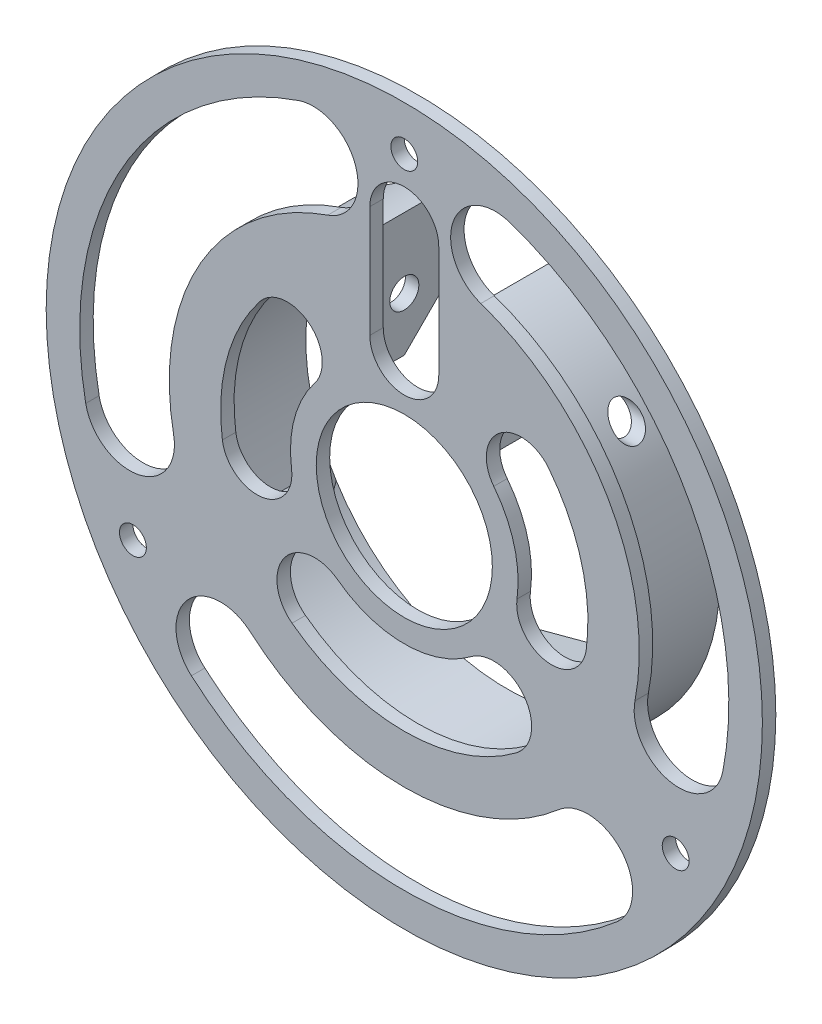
ISO-10303-21;
HEADER;
FILE_DESCRIPTION(('STEP AP214'),'2;1');
FILE_NAME('part.step','',(''),(''),'','','');
FILE_SCHEMA(('AUTOMOTIVE_DESIGN { 1 0 10303 214 1 1 1 1 }'));
ENDSEC;
DATA;
#1=APPLICATION_CONTEXT('core data for automotive mechanical design processes');
#2=APPLICATION_PROTOCOL_DEFINITION('international standard','automotive_design',2000,#1);
#3=PRODUCT_CONTEXT('',#1,'mechanical');
#4=PRODUCT('Part','Part','',(#3));
#5=PRODUCT_RELATED_PRODUCT_CATEGORY('part','',(#4));
#6=PRODUCT_DEFINITION_FORMATION('','',#4);
#7=PRODUCT_DEFINITION_CONTEXT('part definition',#1,'design');
#8=PRODUCT_DEFINITION('design','',#6,#7);
#9=PRODUCT_DEFINITION_SHAPE('','',#8);
#10=(LENGTH_UNIT() NAMED_UNIT(*) SI_UNIT(.MILLI.,.METRE.));
#11=(NAMED_UNIT(*) PLANE_ANGLE_UNIT() SI_UNIT($,.RADIAN.));
#12=(NAMED_UNIT(*) SI_UNIT($,.STERADIAN.) SOLID_ANGLE_UNIT());
#13=UNCERTAINTY_MEASURE_WITH_UNIT(LENGTH_MEASURE(1.E-05),#10,'distance_accuracy_value','');
#14=(GEOMETRIC_REPRESENTATION_CONTEXT(3) GLOBAL_UNCERTAINTY_ASSIGNED_CONTEXT((#13)) GLOBAL_UNIT_ASSIGNED_CONTEXT((#10,
#11,#12)) REPRESENTATION_CONTEXT('',''));
#15=CARTESIAN_POINT('',(0.,0.,0.));
#16=DIRECTION('',(0.,0.,1.));
#17=DIRECTION('',(1.,0.,0.));
#18=AXIS2_PLACEMENT_3D('',#15,#16,#17);
#19=CARTESIAN_POINT('',(0.,0.,20.));
#20=DIRECTION('',(0.,0.,-1.));
#21=DIRECTION('',(-1.,0.,0.));
#22=AXIS2_PLACEMENT_3D('',#19,#20,#21);
#23=CYLINDRICAL_SURFACE('',#22,45.);
#24=CARTESIAN_POINT('',(0.,0.,20.));
#25=DIRECTION('',(0.,0.,1.));
#26=DIRECTION('',(1.,0.,0.));
#27=AXIS2_PLACEMENT_3D('',#24,#25,#26);
#28=CIRCLE('',#27,45.);
#29=CARTESIAN_POINT('',(-16.,42.0594816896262,20.));
#30=VERTEX_POINT('',#29);
#31=CARTESIAN_POINT('',(-39.6994865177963,-21.188458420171,20.));
#32=VERTEX_POINT('',#31);
#33=EDGE_CURVE('E741',#30,#32,#28,.T.);
#34=ORIENTED_EDGE('',*,*,#33,.T.);
#35=DIRECTION('',(0.,0.,1.));
#36=VECTOR('',#35,1.);
#37=CARTESIAN_POINT('',(-39.6994865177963,-21.188458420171,0.));
#38=LINE('',#37,#36);
#39=CARTESIAN_POINT('',(-39.6994865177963,-21.188458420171,0.));
#40=VERTEX_POINT('',#39);
#41=EDGE_CURVE('E414',#40,#32,#38,.T.);
#42=ORIENTED_EDGE('',*,*,#41,.F.);
#43=CARTESIAN_POINT('',(0.,0.,0.));
#44=DIRECTION('',(0.,0.,1.));
#45=DIRECTION('',(1.,0.,0.));
#46=AXIS2_PLACEMENT_3D('',#43,#44,#45);
#47=CIRCLE('',#46,45.);
#48=CARTESIAN_POINT('',(-16.,42.0594816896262,0.));
#49=VERTEX_POINT('',#48);
#50=EDGE_CURVE('E743',#49,#40,#47,.T.);
#51=ORIENTED_EDGE('',*,*,#50,.F.);
#52=DIRECTION('',(0.,0.,-1.));
#53=VECTOR('',#52,1.);
#54=CARTESIAN_POINT('',(-16.,42.0594816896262,20.));
#55=LINE('',#54,#53);
#56=EDGE_CURVE('E927',#49,#30,#55,.F.);
#57=ORIENTED_EDGE('',*,*,#56,.T.);
#58=EDGE_LOOP('',(#34,#42,#51,#57));
#59=FACE_BOUND('',#58,.T.);
#60=ADVANCED_FACE('F32',(#59),#23,.F.);
#61=CARTESIAN_POINT('',(-38.1994865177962,-23.7865346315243,0.));
#62=VERTEX_POINT('',#61);
#63=CARTESIAN_POINT('',(38.1994865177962,-23.7865346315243,0.));
#64=VERTEX_POINT('',#63);
#65=EDGE_CURVE('E740',#62,#64,#47,.T.);
#66=ORIENTED_EDGE('',*,*,#65,.F.);
#67=DIRECTION('',(0.,0.,1.));
#68=VECTOR('',#67,1.);
#69=CARTESIAN_POINT('',(-38.1994865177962,-23.7865346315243,0.));
#70=LINE('',#69,#68);
#71=CARTESIAN_POINT('',(-38.1994865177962,-23.7865346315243,20.));
#72=VERTEX_POINT('',#71);
#73=EDGE_CURVE('E411',#62,#72,#70,.T.);
#74=ORIENTED_EDGE('',*,*,#73,.T.);
#75=CARTESIAN_POINT('',(38.1994865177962,-23.7865346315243,20.));
#76=VERTEX_POINT('',#75);
#77=EDGE_CURVE('E746',#72,#76,#28,.T.);
#78=ORIENTED_EDGE('',*,*,#77,.T.);
#79=DIRECTION('',(0.,0.,1.));
#80=VECTOR('',#79,1.);
#81=CARTESIAN_POINT('',(38.1994865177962,-23.7865346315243,0.));
#82=LINE('',#81,#80);
#83=EDGE_CURVE('E426',#64,#76,#82,.T.);
#84=ORIENTED_EDGE('',*,*,#83,.F.);
#85=EDGE_LOOP('',(#66,#74,#78,#84));
#86=FACE_BOUND('',#85,.T.);
#87=ADVANCED_FACE('F560',(#86),#23,.F.);
#88=CARTESIAN_POINT('',(0.,0.,20.));
#89=DIRECTION('',(0.,0.,1.));
#90=DIRECTION('',(1.,0.,0.));
#91=AXIS2_PLACEMENT_3D('',#88,#89,#90);
#92=PLANE('',#91);
#93=DIRECTION('',(0.,1.,0.));
#94=VECTOR('',#93,1.);
#95=CARTESIAN_POINT('',(-7.70056508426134,31.0716952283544,20.));
#96=LINE('',#95,#94);
#97=CARTESIAN_POINT('',(-7.70056508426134,31.0716952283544,20.));
#98=VERTEX_POINT('',#97);
#99=CARTESIAN_POINT('',(-7.70056508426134,55.9776784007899,20.));
#100=VERTEX_POINT('',#99);
#101=EDGE_CURVE('E324',#98,#100,#96,.T.);
#102=ORIENTED_EDGE('',*,*,#101,.F.);
#103=CARTESIAN_POINT('',(0.,31.0716952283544,20.));
#104=DIRECTION('',(0.,0.,-1.));
#105=DIRECTION('',(-1.,0.,0.));
#106=AXIS2_PLACEMENT_3D('',#103,#104,#105);
#107=CIRCLE('',#106,7.70056508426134);
#108=CARTESIAN_POINT('',(7.70056508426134,31.0716952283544,20.));
#109=VERTEX_POINT('',#108);
#110=EDGE_CURVE('E47',#109,#98,#107,.T.);
#111=ORIENTED_EDGE('',*,*,#110,.F.);
#112=DIRECTION('',(0.,-1.,0.));
#113=VECTOR('',#112,1.);
#114=CARTESIAN_POINT('',(7.70056508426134,31.0716952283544,20.));
#115=LINE('',#114,#113);
#116=CARTESIAN_POINT('',(7.70056508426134,55.9776784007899,20.));
#117=VERTEX_POINT('',#116);
#118=EDGE_CURVE('E331',#117,#109,#115,.T.);
#119=ORIENTED_EDGE('',*,*,#118,.F.);
#120=CARTESIAN_POINT('',(0.,55.9776784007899,20.));
#121=DIRECTION('',(0.,0.,-1.));
#122=DIRECTION('',(-1.,0.,0.));
#123=AXIS2_PLACEMENT_3D('',#120,#121,#122);
#124=CIRCLE('',#123,7.70056508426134);
#125=EDGE_CURVE('E315',#100,#117,#124,.T.);
#126=ORIENTED_EDGE('',*,*,#125,.F.);
#127=EDGE_LOOP('',(#102,#111,#119,#126));
#128=FACE_BOUND('',#127,.T.);
#129=CARTESIAN_POINT('',(0.,0.,20.));
#130=DIRECTION('',(0.,0.,-1.));
#131=DIRECTION('',(-1.,0.,0.));
#132=AXIS2_PLACEMENT_3D('',#129,#130,#131);
#133=CIRCLE('',#132,19.6694698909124);
#134=CARTESIAN_POINT('',(-19.6694698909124,0.,20.));
#135=VERTEX_POINT('',#134);
#136=EDGE_CURVE('E338',#135,#135,#133,.T.);
#137=ORIENTED_EDGE('',*,*,#136,.F.);
#138=EDGE_LOOP('',(#137));
#139=FACE_BOUND('',#138,.T.);
#140=CARTESIAN_POINT('',(0.,1.31838984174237E-13,20.));
#141=DIRECTION('',(0.,0.,-1.));
#142=DIRECTION('',(-1.,0.,0.));
#143=AXIS2_PLACEMENT_3D('',#140,#141,#142);
#144=CIRCLE('',#143,41.6849378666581);
#145=CARTESIAN_POINT('',(25.0803442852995,-33.2958011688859,20.));
#146=VERTEX_POINT('',#145);
#147=CARTESIAN_POINT('',(-25.0803442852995,-33.2958011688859,20.));
#148=VERTEX_POINT('',#147);
#149=EDGE_CURVE('E346',#146,#148,#144,.T.);
#150=ORIENTED_EDGE('',*,*,#149,.F.);
#151=CARTESIAN_POINT('',(19.9919444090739,-26.5406167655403,20.));
#152=DIRECTION('',(0.,0.,-1.));
#153=DIRECTION('',(-1.,0.,0.));
#154=AXIS2_PLACEMENT_3D('',#151,#152,#153);
#155=CIRCLE('',#154,8.45720578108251);
#156=CARTESIAN_POINT('',(14.9035445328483,-19.7854323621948,20.));
#157=VERTEX_POINT('',#156);
#158=EDGE_CURVE('E344',#157,#146,#155,.T.);
#159=ORIENTED_EDGE('',*,*,#158,.F.);
#160=CARTESIAN_POINT('',(0.,1.31838984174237E-13,20.));
#161=DIRECTION('',(0.,0.,1.));
#162=DIRECTION('',(-1.,0.,0.));
#163=AXIS2_PLACEMENT_3D('',#160,#161,#162);
#164=CIRCLE('',#163,24.7705263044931);
#165=CARTESIAN_POINT('',(-14.9035445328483,-19.7854323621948,20.));
#166=VERTEX_POINT('',#165);
#167=EDGE_CURVE('E352',#166,#157,#164,.T.);
#168=ORIENTED_EDGE('',*,*,#167,.F.);
#169=CARTESIAN_POINT('',(-19.9919444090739,-26.5406167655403,20.));
#170=DIRECTION('',(0.,0.,-1.));
#171=DIRECTION('',(-1.,0.,0.));
#172=AXIS2_PLACEMENT_3D('',#169,#170,#171);
#173=CIRCLE('',#172,8.45720578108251);
#174=EDGE_CURVE('E349',#148,#166,#173,.T.);
#175=ORIENTED_EDGE('',*,*,#174,.F.);
#176=EDGE_LOOP('',(#150,#159,#168,#175));
#177=FACE_BOUND('',#176,.T.);
#178=CARTESIAN_POINT('',(-8.49320613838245E-12,-1.98886046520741E-12,20.));
#179=DIRECTION('',(0.,0.,1.));
#180=DIRECTION('',(1.,0.,0.));
#181=AXIS2_PLACEMENT_3D('',#178,#179,#180);
#182=CIRCLE('',#181,25.4286392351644);
#183=CARTESIAN_POINT('',(-19.9919444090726,15.7142563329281,20.));
#184=VERTEX_POINT('',#183);
#185=CARTESIAN_POINT('',(-25.1876187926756,-3.49278583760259,20.));
#186=VERTEX_POINT('',#185);
#187=EDGE_CURVE('E366',#184,#186,#182,.T.);
#188=ORIENTED_EDGE('',*,*,#187,.F.);
#189=CARTESIAN_POINT('',(-26.1235753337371,20.5338985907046,20.));
#190=DIRECTION('',(0.,0.,-1.));
#191=DIRECTION('',(1.,0.,0.));
#192=AXIS2_PLACEMENT_3D('',#189,#190,#191);
#193=CIRCLE('',#192,7.79909285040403);
#194=CARTESIAN_POINT('',(-32.2552062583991,25.3535408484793,20.));
#195=VERTEX_POINT('',#194);
#196=EDGE_CURVE('E358',#195,#184,#193,.T.);
#197=ORIENTED_EDGE('',*,*,#196,.F.);
#198=CARTESIAN_POINT('',(-8.49320613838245E-12,-1.98886046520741E-12,20.));
#199=DIRECTION('',(0.,0.,-1.));
#200=DIRECTION('',(1.,0.,0.));
#201=AXIS2_PLACEMENT_3D('',#198,#199,#200);
#202=CIRCLE('',#201,41.0268249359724);
#203=CARTESIAN_POINT('',(-40.6379601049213,-5.63529616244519,20.));
#204=VERTEX_POINT('',#203);
#205=EDGE_CURVE('E372',#204,#195,#202,.T.);
#206=ORIENTED_EDGE('',*,*,#205,.F.);
#207=CARTESIAN_POINT('',(-32.9127894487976,-4.564041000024,20.));
#208=DIRECTION('',(0.,0.,-1.));
#209=DIRECTION('',(1.,0.,0.));
#210=AXIS2_PLACEMENT_3D('',#207,#208,#209);
#211=CIRCLE('',#210,7.79909285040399);
#212=EDGE_CURVE('E369',#186,#204,#211,.T.);
#213=ORIENTED_EDGE('',*,*,#212,.F.);
#214=EDGE_LOOP('',(#188,#197,#206,#213));
#215=FACE_BOUND('',#214,.T.);
#216=CARTESIAN_POINT('',(-8.49320613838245E-12,-1.98886046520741E-12,20.));
#217=DIRECTION('',(0.,0.,-1.));
#218=DIRECTION('',(-1.,0.,0.));
#219=AXIS2_PLACEMENT_3D('',#216,#217,#218);
#220=CIRCLE('',#219,41.0268249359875);
#221=CARTESIAN_POINT('',(32.2552062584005,25.3535408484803,20.));
#222=VERTEX_POINT('',#221);
#223=CARTESIAN_POINT('',(40.6379601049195,-5.63529616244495,20.));
#224=VERTEX_POINT('',#223);
#225=EDGE_CURVE('E386',#222,#224,#220,.T.);
#226=ORIENTED_EDGE('',*,*,#225,.F.);
#227=CARTESIAN_POINT('',(26.1235753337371,20.5338985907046,20.));
#228=DIRECTION('',(0.,0.,-1.));
#229=DIRECTION('',(-1.,0.,0.));
#230=AXIS2_PLACEMENT_3D('',#227,#228,#229);
#231=CIRCLE('',#230,7.79909285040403);
#232=CARTESIAN_POINT('',(19.991944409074,15.7142563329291,20.));
#233=VERTEX_POINT('',#232);
#234=EDGE_CURVE('E378',#233,#222,#231,.T.);
#235=ORIENTED_EDGE('',*,*,#234,.F.);
#236=CARTESIAN_POINT('',(-8.49320613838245E-12,-1.98886046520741E-12,20.));
#237=DIRECTION('',(0.,0.,1.));
#238=DIRECTION('',(-1.,0.,0.));
#239=AXIS2_PLACEMENT_3D('',#236,#237,#238);
#240=CIRCLE('',#239,25.4286392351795);
#241=CARTESIAN_POINT('',(25.1876187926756,-3.49278583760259,20.));
#242=VERTEX_POINT('',#241);
#243=EDGE_CURVE('E392',#242,#233,#240,.T.);
#244=ORIENTED_EDGE('',*,*,#243,.F.);
#245=CARTESIAN_POINT('',(32.9127894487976,-4.564041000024,20.));
#246=DIRECTION('',(0.,0.,-1.));
#247=DIRECTION('',(-1.,0.,0.));
#248=AXIS2_PLACEMENT_3D('',#245,#246,#247);
#249=CIRCLE('',#248,7.79909285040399);
#250=EDGE_CURVE('E389',#224,#242,#249,.T.);
#251=ORIENTED_EDGE('',*,*,#250,.F.);
#252=EDGE_LOOP('',(#226,#235,#244,#251));
#253=FACE_BOUND('',#252,.T.);
#254=CARTESIAN_POINT('',(4.64596081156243E-13,-2.68234672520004E-13,20.));
#255=DIRECTION('',(0.,0.,1.));
#256=DIRECTION('',(-1.,0.,0.));
#257=AXIS2_PLACEMENT_3D('',#254,#255,#256);
#258=CIRCLE('',#257,52.5000000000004);
#259=CARTESIAN_POINT('',(-17.0962104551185,49.6383882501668,20.));
#260=VERTEX_POINT('',#259);
#261=CARTESIAN_POINT('',(-51.5362104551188,-10.0134415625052,20.));
#262=VERTEX_POINT('',#261);
#263=EDGE_CURVE('E822',#260,#262,#258,.T.);
#264=ORIENTED_EDGE('',*,*,#263,.F.);
#265=CARTESIAN_POINT('',(-20.3526314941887,59.0933193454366,20.));
#266=DIRECTION('',(0.,0.,-1.));
#267=DIRECTION('',(-1.,0.,0.));
#268=AXIS2_PLACEMENT_3D('',#265,#266,#267);
#269=CIRCLE('',#268,10.);
#270=CARTESIAN_POINT('',(-23.6090525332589,68.5482504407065,20.));
#271=VERTEX_POINT('',#270);
#272=EDGE_CURVE('E826',#271,#260,#269,.T.);
#273=ORIENTED_EDGE('',*,*,#272,.F.);
#274=CARTESIAN_POINT('',(4.64596081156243E-13,-2.68234672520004E-13,20.));
#275=DIRECTION('',(0.,0.,-1.));
#276=DIRECTION('',(-1.,0.,0.));
#277=AXIS2_PLACEMENT_3D('',#274,#275,#276);
#278=CIRCLE('',#277,72.5000000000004);
#279=CARTESIAN_POINT('',(-71.1690525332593,-13.8280859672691,20.));
#280=VERTEX_POINT('',#279);
#281=EDGE_CURVE('E828',#280,#271,#278,.T.);
#282=ORIENTED_EDGE('',*,*,#281,.F.);
#283=CARTESIAN_POINT('',(-61.352631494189,-11.9207637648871,20.));
#284=DIRECTION('',(0.,0.,-1.));
#285=DIRECTION('',(-1.,0.,0.));
#286=AXIS2_PLACEMENT_3D('',#283,#284,#285);
#287=CIRCLE('',#286,9.99999999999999);
#288=EDGE_CURVE('E831',#262,#280,#287,.T.);
#289=ORIENTED_EDGE('',*,*,#288,.F.);
#290=EDGE_LOOP('',(#264,#273,#282,#289));
#291=FACE_BOUND('',#290,.T.);
#292=CARTESIAN_POINT('',(-4.64596081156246E-13,-2.68234672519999E-13,20.));
#293=DIRECTION('',(0.,0.,-1.));
#294=DIRECTION('',(0.500000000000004,0.866025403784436,0.));
#295=AXIS2_PLACEMENT_3D('',#292,#293,#294);
#296=CIRCLE('',#295,72.5000000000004);
#297=CARTESIAN_POINT('',(23.6090525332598,68.5482504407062,20.));
#298=VERTEX_POINT('',#297);
#299=CARTESIAN_POINT('',(71.1690525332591,-13.82808596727,20.));
#300=VERTEX_POINT('',#299);
#301=EDGE_CURVE('E860',#298,#300,#296,.T.);
#302=ORIENTED_EDGE('',*,*,#301,.F.);
#303=CARTESIAN_POINT('',(20.3526314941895,59.0933193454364,20.));
#304=DIRECTION('',(0.,0.,-1.));
#305=DIRECTION('',(0.500000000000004,0.866025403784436,0.));
#306=AXIS2_PLACEMENT_3D('',#303,#304,#305);
#307=CIRCLE('',#306,9.99999999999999);
#308=CARTESIAN_POINT('',(17.0962104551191,49.6383882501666,20.));
#309=VERTEX_POINT('',#308);
#310=EDGE_CURVE('E863',#309,#298,#307,.T.);
#311=ORIENTED_EDGE('',*,*,#310,.F.);
#312=CARTESIAN_POINT('',(-4.64596081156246E-13,-2.68234672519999E-13,20.));
#313=DIRECTION('',(0.,0.,1.));
#314=DIRECTION('',(0.500000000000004,0.866025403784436,0.));
#315=AXIS2_PLACEMENT_3D('',#312,#313,#314);
#316=CIRCLE('',#315,52.5000000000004);
#317=CARTESIAN_POINT('',(51.5362104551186,-10.0134415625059,20.));
#318=VERTEX_POINT('',#317);
#319=EDGE_CURVE('E853',#318,#309,#316,.T.);
#320=ORIENTED_EDGE('',*,*,#319,.F.);
#321=CARTESIAN_POINT('',(61.3526314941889,-11.920763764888,20.));
#322=DIRECTION('',(0.,0.,-1.));
#323=DIRECTION('',(0.500000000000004,0.866025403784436,0.));
#324=AXIS2_PLACEMENT_3D('',#321,#322,#323);
#325=CIRCLE('',#324,10.);
#326=EDGE_CURVE('E857',#300,#318,#325,.T.);
#327=ORIENTED_EDGE('',*,*,#326,.F.);
#328=EDGE_LOOP('',(#302,#311,#320,#327));
#329=FACE_BOUND('',#328,.T.);
#330=CARTESIAN_POINT('',(0.,0.,20.));
#331=DIRECTION('',(0.,0.,1.));
#332=DIRECTION('',(1.,0.,0.));
#333=AXIS2_PLACEMENT_3D('',#330,#331,#332);
#334=CIRCLE('',#333,80.);
#335=CARTESIAN_POINT('',(80.,0.,20.));
#336=VERTEX_POINT('',#335);
#337=EDGE_CURVE('E788',#336,#336,#334,.T.);
#338=ORIENTED_EDGE('',*,*,#337,.F.);
#339=EDGE_LOOP('',(#338));
#340=FACE_BOUND('',#339,.T.);
#341=CARTESIAN_POINT('',(0.,70.,20.));
#342=DIRECTION('',(0.,0.,-1.));
#343=DIRECTION('',(-1.,0.,0.));
#344=AXIS2_PLACEMENT_3D('',#341,#342,#343);
#345=CIRCLE('',#344,3.);
#346=CARTESIAN_POINT('',(-3.,70.,20.));
#347=VERTEX_POINT('',#346);
#348=EDGE_CURVE('E794',#347,#347,#345,.T.);
#349=ORIENTED_EDGE('',*,*,#348,.F.);
#350=EDGE_LOOP('',(#349));
#351=FACE_BOUND('',#350,.T.);
#352=CARTESIAN_POINT('',(60.6217782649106,-35.0000000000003,20.));
#353=DIRECTION('',(0.,0.,-1.));
#354=DIRECTION('',(0.500000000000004,0.866025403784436,0.));
#355=AXIS2_PLACEMENT_3D('',#352,#353,#354);
#356=CIRCLE('',#355,3.);
#357=CARTESIAN_POINT('',(62.1217782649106,-32.401923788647,20.));
#358=VERTEX_POINT('',#357);
#359=EDGE_CURVE('E800',#358,#358,#356,.T.);
#360=ORIENTED_EDGE('',*,*,#359,.F.);
#361=EDGE_LOOP('',(#360));
#362=FACE_BOUND('',#361,.T.);
#363=CARTESIAN_POINT('',(-60.621778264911,-34.9999999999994,20.));
#364=DIRECTION('',(0.,0.,-1.));
#365=DIRECTION('',(0.499999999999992,-0.866025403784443,0.));
#366=AXIS2_PLACEMENT_3D('',#363,#364,#365);
#367=CIRCLE('',#366,3.);
#368=CARTESIAN_POINT('',(-59.1217782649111,-37.5980762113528,20.));
#369=VERTEX_POINT('',#368);
#370=EDGE_CURVE('E806',#369,#369,#367,.T.);
#371=ORIENTED_EDGE('',*,*,#370,.F.);
#372=EDGE_LOOP('',(#371));
#373=FACE_BOUND('',#372,.T.);
#374=CARTESIAN_POINT('',(0.,5.36469345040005E-13,20.));
#375=DIRECTION('',(0.,0.,-1.));
#376=DIRECTION('',(0.499999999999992,-0.866025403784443,0.));
#377=AXIS2_PLACEMENT_3D('',#374,#375,#376);
#378=CIRCLE('',#377,72.5000000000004);
#379=CARTESIAN_POINT('',(47.5599999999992,-54.7201644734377,20.));
#380=VERTEX_POINT('',#379);
#381=CARTESIAN_POINT('',(-47.5600000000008,-54.7201644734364,20.));
#382=VERTEX_POINT('',#381);
#383=EDGE_CURVE('E892',#380,#382,#378,.T.);
#384=ORIENTED_EDGE('',*,*,#383,.F.);
#385=CARTESIAN_POINT('',(40.9999999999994,-47.1725555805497,20.));
#386=DIRECTION('',(0.,0.,-1.));
#387=DIRECTION('',(0.499999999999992,-0.866025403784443,0.));
#388=AXIS2_PLACEMENT_3D('',#385,#386,#387);
#389=CIRCLE('',#388,9.99999999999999);
#390=CARTESIAN_POINT('',(34.4399999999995,-39.6249466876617,20.));
#391=VERTEX_POINT('',#390);
#392=EDGE_CURVE('E895',#391,#380,#389,.T.);
#393=ORIENTED_EDGE('',*,*,#392,.F.);
#394=CARTESIAN_POINT('',(0.,5.36469345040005E-13,20.));
#395=DIRECTION('',(0.,0.,1.));
#396=DIRECTION('',(0.499999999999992,-0.866025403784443,0.));
#397=AXIS2_PLACEMENT_3D('',#394,#395,#396);
#398=CIRCLE('',#397,52.5000000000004);
#399=CARTESIAN_POINT('',(-34.4400000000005,-39.6249466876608,20.));
#400=VERTEX_POINT('',#399);
#401=EDGE_CURVE('E885',#400,#391,#398,.T.);
#402=ORIENTED_EDGE('',*,*,#401,.F.);
#403=CARTESIAN_POINT('',(-41.0000000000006,-47.1725555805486,20.));
#404=DIRECTION('',(0.,0.,-1.));
#405=DIRECTION('',(0.499999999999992,-0.866025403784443,0.));
#406=AXIS2_PLACEMENT_3D('',#403,#404,#405);
#407=CIRCLE('',#406,10.);
#408=EDGE_CURVE('E889',#382,#400,#407,.T.);
#409=ORIENTED_EDGE('',*,*,#408,.F.);
#410=EDGE_LOOP('',(#384,#393,#402,#409));
#411=FACE_BOUND('',#410,.T.);
#412=DIRECTION('',(0.866025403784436,0.500000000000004,0.));
#413=VECTOR('',#412,1.);
#414=CARTESIAN_POINT('',(-22.3789784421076,-11.1884584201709,20.));
#415=LINE('',#414,#413);
#416=CARTESIAN_POINT('',(-22.3789784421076,-11.1884584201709,20.));
#417=VERTEX_POINT('',#416);
#418=EDGE_CURVE('E398',#32,#417,#415,.T.);
#419=ORIENTED_EDGE('',*,*,#418,.F.);
#420=ORIENTED_EDGE('',*,*,#33,.F.);
#421=DIRECTION('',(0.,1.,0.));
#422=VECTOR('',#421,1.);
#423=CARTESIAN_POINT('',(-16.,43.081318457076,20.));
#424=LINE('',#423,#422);
#425=CARTESIAN_POINT('',(-16.,18.081318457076,20.));
#426=VERTEX_POINT('',#425);
#427=EDGE_CURVE('E935',#426,#30,#424,.T.);
#428=ORIENTED_EDGE('',*,*,#427,.F.);
#429=DIRECTION('',(-1.,0.,0.));
#430=VECTOR('',#429,1.);
#431=CARTESIAN_POINT('',(-13.,18.081318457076,20.));
#432=LINE('',#431,#430);
#433=CARTESIAN_POINT('',(-13.,18.081318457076,20.));
#434=VERTEX_POINT('',#433);
#435=EDGE_CURVE('E938',#434,#426,#432,.T.);
#436=ORIENTED_EDGE('',*,*,#435,.F.);
#437=DIRECTION('',(0.,1.,0.));
#438=VECTOR('',#437,1.);
#439=CARTESIAN_POINT('',(-13.,55.2993134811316,20.));
#440=LINE('',#439,#438);
#441=CARTESIAN_POINT('',(-13.,45.6864312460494,20.));
#442=VERTEX_POINT('',#441);
#443=EDGE_CURVE('E588',#434,#442,#440,.T.);
#444=ORIENTED_EDGE('',*,*,#443,.T.);
#445=CARTESIAN_POINT('',(0.,0.,20.));
#446=DIRECTION('',(0.,0.,1.));
#447=DIRECTION('',(1.,0.,0.));
#448=AXIS2_PLACEMENT_3D('',#445,#446,#447);
#449=CIRCLE('',#448,47.5);
#450=CARTESIAN_POINT('',(13.,45.6864312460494,20.));
#451=VERTEX_POINT('',#450);
#452=EDGE_CURVE('E754',#442,#451,#449,.T.);
#453=ORIENTED_EDGE('',*,*,#452,.T.);
#454=DIRECTION('',(0.,-1.,0.));
#455=VECTOR('',#454,1.);
#456=CARTESIAN_POINT('',(13.,55.2993134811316,20.));
#457=LINE('',#456,#455);
#458=CARTESIAN_POINT('',(13.,18.081318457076,20.));
#459=VERTEX_POINT('',#458);
#460=EDGE_CURVE('E915',#451,#459,#457,.T.);
#461=ORIENTED_EDGE('',*,*,#460,.T.);
#462=DIRECTION('',(-1.,0.,0.));
#463=VECTOR('',#462,1.);
#464=CARTESIAN_POINT('',(13.,18.081318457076,20.));
#465=LINE('',#464,#463);
#466=CARTESIAN_POINT('',(16.,18.081318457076,20.));
#467=VERTEX_POINT('',#466);
#468=EDGE_CURVE('E924',#467,#459,#465,.T.);
#469=ORIENTED_EDGE('',*,*,#468,.F.);
#470=DIRECTION('',(0.,-1.,0.));
#471=VECTOR('',#470,1.);
#472=CARTESIAN_POINT('',(16.,0.,20.));
#473=LINE('',#472,#471);
#474=CARTESIAN_POINT('',(16.,42.0594816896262,20.));
#475=VERTEX_POINT('',#474);
#476=EDGE_CURVE('E759',#475,#467,#473,.T.);
#477=ORIENTED_EDGE('',*,*,#476,.F.);
#478=CARTESIAN_POINT('',(39.6994865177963,-21.188458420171,20.));
#479=VERTEX_POINT('',#478);
#480=EDGE_CURVE('E748',#479,#475,#28,.T.);
#481=ORIENTED_EDGE('',*,*,#480,.F.);
#482=DIRECTION('',(0.866025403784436,-0.500000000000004,0.));
#483=VECTOR('',#482,1.);
#484=CARTESIAN_POINT('',(22.3789784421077,-11.1884584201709,20.));
#485=LINE('',#484,#483);
#486=CARTESIAN_POINT('',(22.3789784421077,-11.1884584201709,20.));
#487=VERTEX_POINT('',#486);
#488=EDGE_CURVE('E421',#487,#479,#485,.T.);
#489=ORIENTED_EDGE('',*,*,#488,.F.);
#490=DIRECTION('',(0.500000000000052,0.866025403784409,0.));
#491=VECTOR('',#490,1.);
#492=CARTESIAN_POINT('',(20.8789784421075,-13.7865346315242,20.));
#493=LINE('',#492,#491);
#494=CARTESIAN_POINT('',(20.8789784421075,-13.7865346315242,20.));
#495=VERTEX_POINT('',#494);
#496=EDGE_CURVE('E418',#495,#487,#493,.T.);
#497=ORIENTED_EDGE('',*,*,#496,.F.);
#498=DIRECTION('',(-0.866025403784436,0.500000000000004,0.));
#499=VECTOR('',#498,1.);
#500=CARTESIAN_POINT('',(20.8789784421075,-13.7865346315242,20.));
#501=LINE('',#500,#499);
#502=EDGE_CURVE('E416',#76,#495,#501,.T.);
#503=ORIENTED_EDGE('',*,*,#502,.F.);
#504=ORIENTED_EDGE('',*,*,#77,.F.);
#505=DIRECTION('',(-0.866025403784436,-0.500000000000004,0.));
#506=VECTOR('',#505,1.);
#507=CARTESIAN_POINT('',(-20.8789784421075,-13.7865346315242,20.));
#508=LINE('',#507,#506);
#509=CARTESIAN_POINT('',(-20.8789784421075,-13.7865346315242,20.));
#510=VERTEX_POINT('',#509);
#511=EDGE_CURVE('E409',#510,#72,#508,.T.);
#512=ORIENTED_EDGE('',*,*,#511,.F.);
#513=DIRECTION('',(0.500000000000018,-0.866025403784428,0.));
#514=VECTOR('',#513,1.);
#515=CARTESIAN_POINT('',(-20.8789784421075,-13.7865346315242,20.));
#516=LINE('',#515,#514);
#517=EDGE_CURVE('E406',#417,#510,#516,.T.);
#518=ORIENTED_EDGE('',*,*,#517,.F.);
#519=EDGE_LOOP('',(#419,#420,#428,#436,#444,#453,#461,#469,#477,#481,#489,#497,#503,#504,#512,#518));
#520=FACE_BOUND('',#519,.T.);
#521=ADVANCED_FACE('F328',(#128,#139,#177,#215,#253,#291,#329,#340,#351,#362,#373,#411,#520),
#92,.F.);
#522=CARTESIAN_POINT('',(36.1340025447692,26.8204000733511,10.));
#523=CARTESIAN_POINT('',(36.134002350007,26.8204003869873,10.0778138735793));
#524=CARTESIAN_POINT('',(36.1319250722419,26.8231996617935,10.155648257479));
#525=CARTESIAN_POINT('',(36.1236420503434,26.8343535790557,10.3107309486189));
#526=CARTESIAN_POINT('',(36.11743378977,26.842711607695,10.3879788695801));
#527=CARTESIAN_POINT('',(36.1009515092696,26.8648746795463,10.5414077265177));
#528=CARTESIAN_POINT('',(36.0906697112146,26.8786901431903,10.6175863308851));
#529=CARTESIAN_POINT('',(36.0661769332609,26.9115457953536,10.7681749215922));
#530=CARTESIAN_POINT('',(36.0519642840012,26.9305882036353,10.842584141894));
#531=CARTESIAN_POINT('',(36.0038334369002,26.994941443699,11.0616363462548));
#532=CARTESIAN_POINT('',(35.9643246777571,27.0476106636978,11.2029910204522));
#533=CARTESIAN_POINT('',(35.8721445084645,27.1697453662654,11.4733515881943));
#534=CARTESIAN_POINT('',(35.8194769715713,27.2392059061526,11.6023611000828));
#535=CARTESIAN_POINT('',(35.6991775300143,27.3966988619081,11.8539673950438));
#536=CARTESIAN_POINT('',(35.6308132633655,27.485624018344,11.9756518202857));
#537=CARTESIAN_POINT('',(35.4835364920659,27.6754968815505,12.2020023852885));
#538=CARTESIAN_POINT('',(35.4046170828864,27.7764524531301,12.3066572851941));
#539=CARTESIAN_POINT('',(35.2003792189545,28.0351776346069,12.5423069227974));
#540=CARTESIAN_POINT('',(35.0702567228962,28.1979397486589,12.663703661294));
#541=CARTESIAN_POINT('',(34.7968562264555,28.5346481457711,12.8711034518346));
#542=CARTESIAN_POINT('',(34.6535526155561,28.7086159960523,12.9570357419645));
#543=CARTESIAN_POINT('',(34.3197139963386,29.107401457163,13.1131997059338));
#544=CARTESIAN_POINT('',(34.126510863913,29.3337893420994,13.1737086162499));
#545=CARTESIAN_POINT('',(33.7317657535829,29.7868863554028,13.2457420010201));
#546=CARTESIAN_POINT('',(33.5302181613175,30.0135955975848,13.2572329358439));
#547=CARTESIAN_POINT('',(33.1214528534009,30.4641256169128,13.2340297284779));
#548=CARTESIAN_POINT('',(32.9141965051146,30.6878825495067,13.1987992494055));
#549=CARTESIAN_POINT('',(32.5013024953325,31.1248385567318,13.0824968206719));
#550=CARTESIAN_POINT('',(32.2956646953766,31.3380385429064,13.0014288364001));
#551=CARTESIAN_POINT('',(31.9205816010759,31.7196754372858,12.8074138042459));
#552=CARTESIAN_POINT('',(31.7501097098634,31.8901935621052,12.7005438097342));
#553=CARTESIAN_POINT('',(31.4205083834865,32.2149779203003,12.4505492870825));
#554=CARTESIAN_POINT('',(31.2613612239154,32.3692697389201,12.3074830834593));
#555=CARTESIAN_POINT('',(31.0093311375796,32.6104562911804,12.0329436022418));
#556=CARTESIAN_POINT('',(30.9112002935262,32.7034167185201,11.9116250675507));
#557=CARTESIAN_POINT('',(30.7287750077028,32.8748833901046,11.6497783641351));
#558=CARTESIAN_POINT('',(30.6444595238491,32.953411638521,11.5092800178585));
#559=CARTESIAN_POINT('',(30.511576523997,33.076427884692,11.2421718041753));
#560=CARTESIAN_POINT('',(30.4592219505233,33.1246048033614,11.1191595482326));
#561=CARTESIAN_POINT('',(30.3698209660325,33.2065910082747,10.8630113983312));
#562=CARTESIAN_POINT('',(30.3327623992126,33.2404117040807,10.729883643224));
#563=CARTESIAN_POINT('',(30.2908842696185,33.2785618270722,10.5245358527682));
#564=CARTESIAN_POINT('',(30.2791876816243,33.2892016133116,10.4548021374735));
#565=CARTESIAN_POINT('',(30.2607600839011,33.305953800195,10.3141569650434));
#566=CARTESIAN_POINT('',(30.2540266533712,33.3120684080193,10.2432460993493));
#567=CARTESIAN_POINT('',(30.2457147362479,33.3196154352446,10.1008888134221));
#568=CARTESIAN_POINT('',(30.2441350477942,33.3210489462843,10.0294425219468));
#569=CARTESIAN_POINT('',(30.2461603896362,33.319210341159,9.88670715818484));
#570=CARTESIAN_POINT('',(30.2497649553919,33.3159386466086,9.81541807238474));
#571=CARTESIAN_POINT('',(30.2666845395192,33.3005714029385,9.62071274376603));
#572=CARTESIAN_POINT('',(30.2852360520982,33.2837153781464,9.49806433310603));
#573=CARTESIAN_POINT('',(30.3364634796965,33.2370298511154,9.25843223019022));
#574=CARTESIAN_POINT('',(30.3691453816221,33.2071948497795,9.14145096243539));
#575=CARTESIAN_POINT('',(30.4586063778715,33.1251868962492,8.87974212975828));
#576=CARTESIAN_POINT('',(30.5197247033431,33.0689464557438,8.73777337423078));
#577=CARTESIAN_POINT('',(30.657599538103,32.9411663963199,8.4691693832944));
#578=CARTESIAN_POINT('',(30.7343857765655,32.8695976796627,8.34256403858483));
#579=CARTESIAN_POINT('',(30.9321565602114,32.6837355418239,8.05775801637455));
#580=CARTESIAN_POINT('',(31.0585646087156,32.5637779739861,7.9070542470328));
#581=CARTESIAN_POINT('',(31.3252643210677,32.3073087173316,7.63487560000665));
#582=CARTESIAN_POINT('',(31.4655810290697,32.1707670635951,7.51345485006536));
#583=CARTESIAN_POINT('',(31.707938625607,31.9315776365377,7.33295332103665));
#584=CARTESIAN_POINT('',(31.8077475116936,31.832181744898,7.26639096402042));
#585=CARTESIAN_POINT('',(32.0100676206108,31.6287233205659,7.14550530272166));
#586=CARTESIAN_POINT('',(32.1125797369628,31.5246592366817,7.09118610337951));
#587=CARTESIAN_POINT('',(32.3193462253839,31.3126458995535,6.99452096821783));
#588=CARTESIAN_POINT('',(32.4236016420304,31.2046942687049,6.95218250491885));
#589=CARTESIAN_POINT('',(32.6329416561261,30.9857083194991,6.879419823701));
#590=CARTESIAN_POINT('',(32.738026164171,30.8746743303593,6.84899433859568));
#591=CARTESIAN_POINT('',(33.0564957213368,30.5346530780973,6.77489185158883));
#592=CARTESIAN_POINT('',(33.2702357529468,30.3016733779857,6.74971174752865));
#593=CARTESIAN_POINT('',(33.6925609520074,29.8313779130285,6.75029286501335));
#594=CARTESIAN_POINT('',(33.9011501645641,29.5940658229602,6.77601273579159));
#595=CARTESIAN_POINT('',(34.2718364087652,29.1634596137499,6.87273977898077));
#596=CARTESIAN_POINT('',(34.435683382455,28.9697273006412,6.93503780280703));
#597=CARTESIAN_POINT('',(34.7517820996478,28.5897603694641,7.09949271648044));
#598=CARTESIAN_POINT('',(34.9040476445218,28.4035169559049,7.20160124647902));
#599=CARTESIAN_POINT('',(35.160978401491,28.0844854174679,7.42167103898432));
#600=CARTESIAN_POINT('',(35.2688694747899,27.9487682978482,7.53160638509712));
#601=CARTESIAN_POINT('',(35.4708810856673,27.6919334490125,7.7780722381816));
#602=CARTESIAN_POINT('',(35.5650180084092,27.5707983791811,7.91457064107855));
#603=CARTESIAN_POINT('',(35.7209987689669,27.3682983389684,8.18757266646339));
#604=CARTESIAN_POINT('',(35.7856120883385,27.2836753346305,8.32006910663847));
#605=CARTESIAN_POINT('',(35.9002751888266,27.1326233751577,8.60095649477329));
#606=CARTESIAN_POINT('',(35.9503300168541,27.066188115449,8.74934191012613));
#607=CARTESIAN_POINT('',(36.0289661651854,26.9614064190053,9.04180639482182));
#608=CARTESIAN_POINT('',(36.0592873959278,26.9207953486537,9.18460773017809));
#609=CARTESIAN_POINT('',(36.1050500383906,26.8593906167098,9.47651671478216));
#610=CARTESIAN_POINT('',(36.1205294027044,26.8385464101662,9.62560725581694));
#611=CARTESIAN_POINT('',(36.1301630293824,26.8255720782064,9.8129062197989));
#612=CARTESIAN_POINT('',(36.131601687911,26.8236343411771,9.85027770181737));
#613=CARTESIAN_POINT('',(36.1335215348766,26.8210482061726,9.92509786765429));
#614=CARTESIAN_POINT('',(36.1340026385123,26.8203999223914,9.96254655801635));
#615=CARTESIAN_POINT('',(36.1340025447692,26.8204000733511,10.));
#616=B_SPLINE_CURVE_WITH_KNOTS('',3,(#522,#523,#524,#525,#526,#527,#528,#529,#530,#531,#532,
#533,#534,#535,#536,#537,#538,#539,#540,#541,#542,#543,#544,#545,#546,#547,#548,#549,#550,#551,
#552,#553,#554,#555,#556,#557,#558,#559,#560,#561,#562,#563,#564,#565,#566,#567,#568,#569,#570,
#571,#572,#573,#574,#575,#576,#577,#578,#579,#580,#581,#582,#583,#584,#585,#586,#587,#588,#589,
#590,#591,#592,#593,#594,#595,#596,#597,#598,#599,#600,#601,#602,#603,#604,#605,#606,#607,#608,
#609,#610,#611,#612,#613,#614,#615),.UNSPECIFIED.,.T.,.F.,(4,2,2,2,2,2,2,2,2,2,2,2,2,2,2,2,2,2,
2,2,2,2,2,2,2,2,2,2,2,2,2,2,2,2,2,2,2,2,2,2,2,2,2,2,2,2,4),(0.,0.233399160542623,
0.466940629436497,0.700930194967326,0.935019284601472,1.40052595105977,1.86589575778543,
2.36050818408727,2.85544575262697,3.57497855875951,4.29594018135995,5.20233296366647,
6.10934582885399,7.02686137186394,7.94429755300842,8.73287184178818,9.52018347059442,
10.0634296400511,10.6058405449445,11.0306003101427,11.4550218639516,11.6692589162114,
11.8833914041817,12.0974739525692,12.3115373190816,12.6852176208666,13.059056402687,
13.5497657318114,14.0414149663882,14.728861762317,15.4175696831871,15.8844050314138,
16.351396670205,16.8186789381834,17.2859114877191,18.2331395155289,19.1795983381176,
19.9604931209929,20.7404422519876,21.354042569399,21.9669058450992,22.474773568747,
22.9824650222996,23.435105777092,23.8865859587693,23.998915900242,24.1112557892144),.UNSPECIFIED.);
#617=CARTESIAN_POINT('',(36.1340025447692,26.8204000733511,10.));
#618=VERTEX_POINT('',#617);
#619=EDGE_CURVE('E448',#618,#618,#616,.T.);
#620=ORIENTED_EDGE('',*,*,#619,.F.);
#621=EDGE_LOOP('',(#620));
#622=FACE_BOUND('',#621,.T.);
#623=CARTESIAN_POINT('',(39.6994865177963,-21.188458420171,0.));
#624=VERTEX_POINT('',#623);
#625=CARTESIAN_POINT('',(16.,42.0594816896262,0.));
#626=VERTEX_POINT('',#625);
#627=EDGE_CURVE('E734',#624,#626,#47,.T.);
#628=ORIENTED_EDGE('',*,*,#627,.F.);
#629=DIRECTION('',(0.,0.,1.));
#630=VECTOR('',#629,1.);
#631=CARTESIAN_POINT('',(39.6994865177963,-21.188458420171,0.));
#632=LINE('',#631,#630);
#633=EDGE_CURVE('E423',#624,#479,#632,.T.);
#634=ORIENTED_EDGE('',*,*,#633,.T.);
#635=ORIENTED_EDGE('',*,*,#480,.T.);
#636=DIRECTION('',(0.,0.,-1.));
#637=VECTOR('',#636,1.);
#638=CARTESIAN_POINT('',(16.,42.0594816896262,20.));
#639=LINE('',#638,#637);
#640=EDGE_CURVE('E736',#475,#626,#639,.T.);
#641=ORIENTED_EDGE('',*,*,#640,.T.);
#642=EDGE_LOOP('',(#628,#634,#635,#641));
#643=FACE_BOUND('',#642,.T.);
#644=ADVANCED_FACE('F559',(#622,#643),#23,.F.);
#645=CARTESIAN_POINT('',(0.,0.,0.));
#646=DIRECTION('',(0.,0.,1.));
#647=DIRECTION('',(1.,0.,0.));
#648=AXIS2_PLACEMENT_3D('',#645,#646,#647);
#649=PLANE('',#648);
#650=DIRECTION('',(0.,1.,0.));
#651=VECTOR('',#650,1.);
#652=CARTESIAN_POINT('',(-13.,0.,0.));
#653=LINE('',#652,#651);
#654=CARTESIAN_POINT('',(-13.,28.081318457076,0.));
#655=VERTEX_POINT('',#654);
#656=CARTESIAN_POINT('',(-13.,45.6864312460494,0.));
#657=VERTEX_POINT('',#656);
#658=EDGE_CURVE('E578',#655,#657,#653,.T.);
#659=ORIENTED_EDGE('',*,*,#658,.F.);
#660=DIRECTION('',(-1.,0.,0.));
#661=VECTOR('',#660,1.);
#662=CARTESIAN_POINT('',(0.,28.0813184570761,0.));
#663=LINE('',#662,#661);
#664=CARTESIAN_POINT('',(-16.,28.0813184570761,0.));
#665=VERTEX_POINT('',#664);
#666=EDGE_CURVE('E580',#655,#665,#663,.T.);
#667=ORIENTED_EDGE('',*,*,#666,.T.);
#668=DIRECTION('',(0.,1.,0.));
#669=VECTOR('',#668,1.);
#670=CARTESIAN_POINT('',(-16.,43.081318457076,0.));
#671=LINE('',#670,#669);
#672=EDGE_CURVE('E934',#665,#49,#671,.T.);
#673=ORIENTED_EDGE('',*,*,#672,.T.);
#674=ORIENTED_EDGE('',*,*,#50,.T.);
#675=DIRECTION('',(0.500000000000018,-0.866025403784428,0.));
#676=VECTOR('',#675,1.);
#677=CARTESIAN_POINT('',(-38.9494865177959,-22.4874965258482,0.));
#678=LINE('',#677,#676);
#679=EDGE_CURVE('E765',#40,#62,#678,.T.);
#680=ORIENTED_EDGE('',*,*,#679,.T.);
#681=ORIENTED_EDGE('',*,*,#65,.T.);
#682=DIRECTION('',(0.500000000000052,0.866025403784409,0.));
#683=VECTOR('',#682,1.);
#684=CARTESIAN_POINT('',(38.9494865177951,-22.4874965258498,0.));
#685=LINE('',#684,#683);
#686=EDGE_CURVE('E763',#64,#624,#685,.T.);
#687=ORIENTED_EDGE('',*,*,#686,.T.);
#688=ORIENTED_EDGE('',*,*,#627,.T.);
#689=DIRECTION('',(0.,-1.,0.));
#690=VECTOR('',#689,1.);
#691=CARTESIAN_POINT('',(16.,43.081318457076,0.));
#692=LINE('',#691,#690);
#693=CARTESIAN_POINT('',(16.,28.0813184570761,0.));
#694=VERTEX_POINT('',#693);
#695=EDGE_CURVE('E923',#626,#694,#692,.T.);
#696=ORIENTED_EDGE('',*,*,#695,.T.);
#697=DIRECTION('',(-1.,0.,0.));
#698=VECTOR('',#697,1.);
#699=CARTESIAN_POINT('',(0.,28.0813184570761,0.));
#700=LINE('',#699,#698);
#701=CARTESIAN_POINT('',(13.,28.0813184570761,0.));
#702=VERTEX_POINT('',#701);
#703=EDGE_CURVE('E596',#694,#702,#700,.T.);
#704=ORIENTED_EDGE('',*,*,#703,.T.);
#705=DIRECTION('',(0.,-1.,0.));
#706=VECTOR('',#705,1.);
#707=CARTESIAN_POINT('',(13.,0.,0.));
#708=LINE('',#707,#706);
#709=CARTESIAN_POINT('',(13.,45.6864312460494,0.));
#710=VERTEX_POINT('',#709);
#711=EDGE_CURVE('E909',#710,#702,#708,.T.);
#712=ORIENTED_EDGE('',*,*,#711,.F.);
#713=CARTESIAN_POINT('',(0.,0.,0.));
#714=DIRECTION('',(0.,0.,1.));
#715=DIRECTION('',(1.,0.,0.));
#716=AXIS2_PLACEMENT_3D('',#713,#714,#715);
#717=CIRCLE('',#716,47.5);
#718=EDGE_CURVE('E584',#657,#710,#717,.T.);
#719=ORIENTED_EDGE('',*,*,#718,.F.);
#720=EDGE_LOOP('',(#659,#667,#673,#674,#680,#681,#687,#688,#696,#704,#712,#719));
#721=FACE_BOUND('',#720,.T.);
#722=ADVANCED_FACE('F566',(#721),#649,.F.);
#723=CARTESIAN_POINT('',(0.,0.,20.));
#724=DIRECTION('',(0.,0.,-1.));
#725=DIRECTION('',(-1.,0.,0.));
#726=AXIS2_PLACEMENT_3D('',#723,#724,#725);
#727=CYLINDRICAL_SURFACE('',#726,47.5);
#728=CARTESIAN_POINT('',(39.2035220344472,26.8204000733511,10.));
#729=CARTESIAN_POINT('',(39.2035216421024,26.8204007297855,10.0792784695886));
#730=CARTESIAN_POINT('',(39.2015344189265,26.8233061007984,10.1585837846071));
#731=CARTESIAN_POINT('',(39.193607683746,26.8348870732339,10.3166075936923));
#732=CARTESIAN_POINT('',(39.1876656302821,26.843566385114,10.3953256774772));
#733=CARTESIAN_POINT('',(39.1718821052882,26.8665935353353,10.5517045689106));
#734=CARTESIAN_POINT('',(39.1620326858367,26.8809529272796,10.6293628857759));
#735=CARTESIAN_POINT('',(39.138555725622,26.9151236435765,10.7828986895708));
#736=CARTESIAN_POINT('',(39.1249265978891,26.9349372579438,10.8587754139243));
#737=CARTESIAN_POINT('',(39.0787278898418,27.0019627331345,11.082235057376));
#738=CARTESIAN_POINT('',(39.0407596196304,27.0568876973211,11.2264945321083));
#739=CARTESIAN_POINT('',(38.9520101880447,27.1844974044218,11.5024067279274));
#740=CARTESIAN_POINT('',(38.901233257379,27.2571762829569,11.6340635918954));
#741=CARTESIAN_POINT('',(38.7853337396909,27.4218629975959,11.8900305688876));
#742=CARTESIAN_POINT('',(38.7195517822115,27.5147450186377,12.0134766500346));
#743=CARTESIAN_POINT('',(38.5776386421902,27.7133669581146,12.2427534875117));
#744=CARTESIAN_POINT('',(38.5015023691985,27.8191131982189,12.3485755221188));
#745=CARTESIAN_POINT('',(38.3276763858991,28.0582325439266,12.5579024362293));
#746=CARTESIAN_POINT('',(38.2284956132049,28.1933007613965,12.6582261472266));
#747=CARTESIAN_POINT('',(38.0212870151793,28.4721265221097,12.8346586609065));
#748=CARTESIAN_POINT('',(37.9132534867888,28.6158896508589,12.9107516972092));
#749=CARTESIAN_POINT('',(37.6686384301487,28.9373802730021,13.0521058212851));
#750=CARTESIAN_POINT('',(37.5306159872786,29.1162350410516,13.1123080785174));
#751=CARTESIAN_POINT('',(37.2481754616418,29.476702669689,13.2007040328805));
#752=CARTESIAN_POINT('',(37.1037541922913,29.6583168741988,13.2288815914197));
#753=CARTESIAN_POINT('',(36.783705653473,30.0547064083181,13.2571165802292));
#754=CARTESIAN_POINT('',(36.6073071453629,30.2693106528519,13.2509065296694));
#755=CARTESIAN_POINT('',(36.2530884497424,30.6926672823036,13.1970130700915));
#756=CARTESIAN_POINT('',(36.0752664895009,30.9014101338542,13.1492657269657));
#757=CARTESIAN_POINT('',(35.8017556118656,31.2170882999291,13.0433004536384));
#758=CARTESIAN_POINT('',(35.7048304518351,31.3278815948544,12.9992663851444));
#759=CARTESIAN_POINT('',(35.5128381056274,31.5453534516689,12.8985128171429));
#760=CARTESIAN_POINT('',(35.4177714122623,31.6520309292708,12.8417900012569));
#761=CARTESIAN_POINT('',(35.2307374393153,31.8600797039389,12.7155713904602));
#762=CARTESIAN_POINT('',(35.1387652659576,31.9614595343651,12.6460970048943));
#763=CARTESIAN_POINT('',(34.9590961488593,32.1578809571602,12.494060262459));
#764=CARTESIAN_POINT('',(34.8713964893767,32.2529265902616,12.4115063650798));
#765=CARTESIAN_POINT('',(34.6810337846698,32.4576625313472,12.2110479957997));
#766=CARTESIAN_POINT('',(34.5799531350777,32.5652536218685,12.0894350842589));
#767=CARTESIAN_POINT('',(34.3910219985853,32.7647133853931,11.8249674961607));
#768=CARTESIAN_POINT('',(34.3031490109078,32.8566088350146,11.6821497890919));
#769=CARTESIAN_POINT('',(34.1618680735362,33.0034088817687,11.4068254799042));
#770=CARTESIAN_POINT('',(34.1050835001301,33.0620359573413,11.27805163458));
#771=CARTESIAN_POINT('',(34.006691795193,33.163231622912,11.0087050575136));
#772=CARTESIAN_POINT('',(33.9650755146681,33.2058098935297,10.8681395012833));
#773=CARTESIAN_POINT('',(33.9163643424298,33.2555373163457,10.6504197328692));
#774=CARTESIAN_POINT('',(33.9023796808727,33.2697898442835,10.5763335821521));
#775=CARTESIAN_POINT('',(33.8794217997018,33.2931682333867,10.4266058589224));
#776=CARTESIAN_POINT('',(33.8704460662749,33.3022966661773,10.3509650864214));
#777=CARTESIAN_POINT('',(33.8577433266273,33.3152112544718,10.19881342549));
#778=CARTESIAN_POINT('',(33.8540145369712,33.318999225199,10.1223028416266));
#779=CARTESIAN_POINT('',(33.8518900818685,33.3211574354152,9.96915700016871));
#780=CARTESIAN_POINT('',(33.8534938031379,33.3195282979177,9.8925217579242));
#781=CARTESIAN_POINT('',(33.8651530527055,33.3076803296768,9.68367089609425));
#782=CARTESIAN_POINT('',(33.8805529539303,33.2920295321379,9.55199147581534));
#783=CARTESIAN_POINT('',(33.9261798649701,33.2455311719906,9.29412187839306));
#784=CARTESIAN_POINT('',(33.9564095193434,33.2146808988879,9.16793268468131));
#785=CARTESIAN_POINT('',(34.0307093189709,33.1385531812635,8.92008461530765));
#786=CARTESIAN_POINT('',(34.0751493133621,33.092889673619,8.79865730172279));
#787=CARTESIAN_POINT('',(34.1750932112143,32.9896677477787,8.56590715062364));
#788=CARTESIAN_POINT('',(34.2306029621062,32.932103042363,8.45458969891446));
#789=CARTESIAN_POINT('',(34.3825412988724,32.7735929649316,8.18590499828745));
#790=CARTESIAN_POINT('',(34.4849502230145,32.6659380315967,8.03585356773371));
#791=CARTESIAN_POINT('',(34.7037633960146,32.4333853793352,7.76140355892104));
#792=CARTESIAN_POINT('',(34.8202024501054,32.3084446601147,7.63707094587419));
#793=CARTESIAN_POINT('',(35.1008496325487,32.0036818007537,7.37764335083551));
#794=CARTESIAN_POINT('',(35.2684303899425,31.8190822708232,7.25181062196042));
#795=CARTESIAN_POINT('',(35.611606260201,31.4345374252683,7.04202127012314));
#796=CARTESIAN_POINT('',(35.787204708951,31.2345856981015,6.95808225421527));
#797=CARTESIAN_POINT('',(36.1437287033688,30.8213635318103,6.83045949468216));
#798=CARTESIAN_POINT('',(36.3246946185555,30.6079402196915,6.78738734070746));
#799=CARTESIAN_POINT('',(36.6850812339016,30.1750560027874,6.74441475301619));
#800=CARTESIAN_POINT('',(36.8645008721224,29.9555913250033,6.74454193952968));
#801=CARTESIAN_POINT('',(37.1364866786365,29.6168018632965,6.77957538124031));
#802=CARTESIAN_POINT('',(37.2313217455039,29.4974849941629,6.79858300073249));
#803=CARTESIAN_POINT('',(37.4184470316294,29.2597445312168,6.85037516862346));
#804=CARTESIAN_POINT('',(37.5107367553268,29.1413211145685,6.88316237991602));
#805=CARTESIAN_POINT('',(37.6917284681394,28.9068418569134,6.96290637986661));
#806=CARTESIAN_POINT('',(37.7804364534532,28.7907822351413,7.00983827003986));
#807=CARTESIAN_POINT('',(37.9534730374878,28.5622905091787,7.11831568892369));
#808=CARTESIAN_POINT('',(38.0378020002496,28.4498581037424,7.17986000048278));
#809=CARTESIAN_POINT('',(38.2288457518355,28.1928867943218,7.34149554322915));
#810=CARTESIAN_POINT('',(38.3334172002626,28.0504365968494,7.44757762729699));
#811=CARTESIAN_POINT('',(38.5295944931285,27.7803562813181,7.68684558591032));
#812=CARTESIAN_POINT('',(38.6212201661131,27.6527035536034,7.81998923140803));
#813=CARTESIAN_POINT('',(38.7753341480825,27.436077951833,8.09002885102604));
#814=CARTESIAN_POINT('',(38.8401360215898,27.3441754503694,8.22321666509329));
#815=CARTESIAN_POINT('',(38.9267876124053,27.2205392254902,8.43553981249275));
#816=CARTESIAN_POINT('',(38.9539292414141,27.1816730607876,8.50846353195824));
#817=CARTESIAN_POINT('',(39.0044068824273,27.109190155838,8.65812193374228));
#818=CARTESIAN_POINT('',(39.0277445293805,27.0755711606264,8.73485496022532));
#819=CARTESIAN_POINT('',(39.0705062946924,27.0138290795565,8.89226501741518));
#820=CARTESIAN_POINT('',(39.089899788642,26.9857490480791,8.97296728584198));
#821=CARTESIAN_POINT('',(39.1242959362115,26.9358568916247,9.13715879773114));
#822=CARTESIAN_POINT('',(39.1393008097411,26.9140415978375,9.22064660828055));
#823=CARTESIAN_POINT('',(39.1646929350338,26.8770781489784,9.38954806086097));
#824=CARTESIAN_POINT('',(39.1750916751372,26.8619134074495,9.47495634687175));
#825=CARTESIAN_POINT('',(39.1911697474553,26.8384503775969,9.64710317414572));
#826=CARTESIAN_POINT('',(39.1968528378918,26.8301466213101,9.73384059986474));
#827=CARTESIAN_POINT('',(39.2012670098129,26.8236959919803,9.85064575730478));
#828=CARTESIAN_POINT('',(39.2021123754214,26.8224604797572,9.88049587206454));
#829=CARTESIAN_POINT('',(39.2032399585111,26.8208124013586,9.94022938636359));
#830=CARTESIAN_POINT('',(39.2035221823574,26.8203998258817,9.97011278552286));
#831=CARTESIAN_POINT('',(39.2035220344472,26.8204000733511,10.));
#832=B_SPLINE_CURVE_WITH_KNOTS('',3,(#728,#729,#730,#731,#732,#733,#734,#735,#736,#737,#738,
#739,#740,#741,#742,#743,#744,#745,#746,#747,#748,#749,#750,#751,#752,#753,#754,#755,#756,#757,
#758,#759,#760,#761,#762,#763,#764,#765,#766,#767,#768,#769,#770,#771,#772,#773,#774,#775,#776,
#777,#778,#779,#780,#781,#782,#783,#784,#785,#786,#787,#788,#789,#790,#791,#792,#793,#794,#795,
#796,#797,#798,#799,#800,#801,#802,#803,#804,#805,#806,#807,#808,#809,#810,#811,#812,#813,#814,
#815,#816,#817,#818,#819,#820,#821,#822,#823,#824,#825,#826,#827,#828,#829,#830,#831),
.UNSPECIFIED.,.T.,.F.,(4,2,2,2,2,2,2,2,2,2,2,2,2,2,2,2,2,2,2,2,2,2,2,2,2,2,2,2,2,2,2,2,2,2,2,2,
2,2,2,2,2,2,2,2,2,2,2,2,2,2,2,4),(0.,0.237803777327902,0.475760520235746,0.714203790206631,
0.952747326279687,1.42728421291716,1.90166456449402,2.40345453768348,2.90549210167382,
3.4892510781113,4.07338912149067,4.77219882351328,5.47136052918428,6.30169347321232,
7.13330672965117,7.59376555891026,8.05434487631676,8.51415785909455,8.97367465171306,
9.54551426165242,10.1163683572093,10.5720537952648,11.0274639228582,11.2573582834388,
11.4871371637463,11.7168379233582,11.9465122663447,12.3449469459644,12.7434527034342,
13.1533142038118,13.5633927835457,14.1933711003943,14.8249457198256,15.658390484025,
16.4921852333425,17.3382699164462,18.1848955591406,18.6451461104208,19.1054856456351,
19.5650195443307,20.0245151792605,20.6403193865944,21.2551699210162,21.7757096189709,
22.0363687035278,22.2969154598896,22.5594138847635,22.8217792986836,23.0834866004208,
23.3449851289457,23.4346358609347,23.5242855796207),.UNSPECIFIED.);
#833=CARTESIAN_POINT('',(39.2035220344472,26.8204000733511,10.));
#834=VERTEX_POINT('',#833);
#835=EDGE_CURVE('E441',#834,#834,#832,.T.);
#836=ORIENTED_EDGE('',*,*,#835,.T.);
#837=EDGE_LOOP('',(#836));
#838=FACE_BOUND('',#837,.T.);
#839=DIRECTION('',(0.,0.,-1.));
#840=VECTOR('',#839,1.);
#841=CARTESIAN_POINT('',(13.,45.6864312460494,20.));
#842=LINE('',#841,#840);
#843=EDGE_CURVE('E897',#451,#710,#842,.T.);
#844=ORIENTED_EDGE('',*,*,#843,.F.);
#845=ORIENTED_EDGE('',*,*,#452,.F.);
#846=DIRECTION('',(0.,0.,-1.));
#847=VECTOR('',#846,1.);
#848=CARTESIAN_POINT('',(-13.,45.6864312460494,20.));
#849=LINE('',#848,#847);
#850=EDGE_CURVE('E587',#657,#442,#849,.F.);
#851=ORIENTED_EDGE('',*,*,#850,.F.);
#852=ORIENTED_EDGE('',*,*,#718,.T.);
#853=EDGE_LOOP('',(#844,#845,#851,#852));
#854=FACE_BOUND('',#853,.T.);
#855=ADVANCED_FACE('F453',(#838,#854),#727,.T.);
#856=CARTESIAN_POINT('',(0.,0.,23.));
#857=DIRECTION('',(0.,0.,-1.));
#858=DIRECTION('',(-1.,0.,0.));
#859=AXIS2_PLACEMENT_3D('',#856,#857,#858);
#860=CYLINDRICAL_SURFACE('',#859,80.);
#861=CARTESIAN_POINT('',(0.,0.,23.));
#862=DIRECTION('',(0.,0.,1.));
#863=DIRECTION('',(1.,0.,0.));
#864=AXIS2_PLACEMENT_3D('',#861,#862,#863);
#865=CIRCLE('',#864,80.);
#866=CARTESIAN_POINT('',(80.,0.,23.));
#867=VERTEX_POINT('',#866);
#868=EDGE_CURVE('E786',#867,#867,#865,.T.);
#869=ORIENTED_EDGE('',*,*,#868,.F.);
#870=EDGE_LOOP('',(#869));
#871=FACE_BOUND('',#870,.T.);
#872=ORIENTED_EDGE('',*,*,#337,.T.);
#873=EDGE_LOOP('',(#872));
#874=FACE_BOUND('',#873,.T.);
#875=ADVANCED_FACE('F555',(#871,#874),#860,.T.);
#876=CARTESIAN_POINT('',(0.,0.,23.));
#877=DIRECTION('',(0.,0.,1.));
#878=DIRECTION('',(1.,0.,0.));
#879=AXIS2_PLACEMENT_3D('',#876,#877,#878);
#880=PLANE('',#879);
#881=CARTESIAN_POINT('',(0.,31.0716952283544,23.));
#882=DIRECTION('',(0.,0.,1.));
#883=DIRECTION('',(1.,0.,0.));
#884=AXIS2_PLACEMENT_3D('',#881,#882,#883);
#885=CIRCLE('',#884,7.70056508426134);
#886=CARTESIAN_POINT('',(-7.70056508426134,31.0716952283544,23.));
#887=VERTEX_POINT('',#886);
#888=CARTESIAN_POINT('',(7.70056508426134,31.0716952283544,23.));
#889=VERTEX_POINT('',#888);
#890=EDGE_CURVE('E11',#887,#889,#885,.T.);
#891=ORIENTED_EDGE('',*,*,#890,.F.);
#892=DIRECTION('',(0.,-1.,0.));
#893=VECTOR('',#892,1.);
#894=CARTESIAN_POINT('',(-7.70056508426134,0.,23.));
#895=LINE('',#894,#893);
#896=CARTESIAN_POINT('',(-7.70056508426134,55.9776784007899,23.));
#897=VERTEX_POINT('',#896);
#898=EDGE_CURVE('E640',#897,#887,#895,.T.);
#899=ORIENTED_EDGE('',*,*,#898,.F.);
#900=CARTESIAN_POINT('',(0.,55.9776784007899,23.));
#901=DIRECTION('',(0.,0.,1.));
#902=DIRECTION('',(1.,0.,0.));
#903=AXIS2_PLACEMENT_3D('',#900,#901,#902);
#904=CIRCLE('',#903,7.70056508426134);
#905=CARTESIAN_POINT('',(7.70056508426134,55.9776784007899,23.));
#906=VERTEX_POINT('',#905);
#907=EDGE_CURVE('E318',#906,#897,#904,.T.);
#908=ORIENTED_EDGE('',*,*,#907,.F.);
#909=DIRECTION('',(0.,1.,0.));
#910=VECTOR('',#909,1.);
#911=CARTESIAN_POINT('',(7.70056508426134,0.,23.));
#912=LINE('',#911,#910);
#913=EDGE_CURVE('E40',#889,#906,#912,.T.);
#914=ORIENTED_EDGE('',*,*,#913,.F.);
#915=EDGE_LOOP('',(#891,#899,#908,#914));
#916=FACE_BOUND('',#915,.T.);
#917=CARTESIAN_POINT('',(0.,0.,23.));
#918=DIRECTION('',(0.,0.,1.));
#919=DIRECTION('',(1.,0.,0.));
#920=AXIS2_PLACEMENT_3D('',#917,#918,#919);
#921=CIRCLE('',#920,19.6694698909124);
#922=CARTESIAN_POINT('',(19.6694698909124,0.,23.));
#923=VERTEX_POINT('',#922);
#924=EDGE_CURVE('E343',#923,#923,#921,.T.);
#925=ORIENTED_EDGE('',*,*,#924,.F.);
#926=EDGE_LOOP('',(#925));
#927=FACE_BOUND('',#926,.T.);
#928=CARTESIAN_POINT('',(19.9919444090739,-26.5406167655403,23.));
#929=DIRECTION('',(0.,0.,1.));
#930=DIRECTION('',(1.,0.,0.));
#931=AXIS2_PLACEMENT_3D('',#928,#929,#930);
#932=CIRCLE('',#931,8.45720578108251);
#933=CARTESIAN_POINT('',(25.0803442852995,-33.2958011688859,23.));
#934=VERTEX_POINT('',#933);
#935=CARTESIAN_POINT('',(14.9035445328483,-19.7854323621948,23.));
#936=VERTEX_POINT('',#935);
#937=EDGE_CURVE('E638',#934,#936,#932,.T.);
#938=ORIENTED_EDGE('',*,*,#937,.F.);
#939=CARTESIAN_POINT('',(0.,1.31838984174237E-13,23.));
#940=DIRECTION('',(0.,0.,1.));
#941=DIRECTION('',(1.,0.,0.));
#942=AXIS2_PLACEMENT_3D('',#939,#940,#941);
#943=CIRCLE('',#942,41.6849378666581);
#944=CARTESIAN_POINT('',(-25.0803442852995,-33.2958011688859,23.));
#945=VERTEX_POINT('',#944);
#946=EDGE_CURVE('E631',#945,#934,#943,.T.);
#947=ORIENTED_EDGE('',*,*,#946,.F.);
#948=CARTESIAN_POINT('',(-19.9919444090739,-26.5406167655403,23.));
#949=DIRECTION('',(0.,0.,1.));
#950=DIRECTION('',(1.,0.,0.));
#951=AXIS2_PLACEMENT_3D('',#948,#949,#950);
#952=CIRCLE('',#951,8.45720578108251);
#953=CARTESIAN_POINT('',(-14.9035445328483,-19.7854323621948,23.));
#954=VERTEX_POINT('',#953);
#955=EDGE_CURVE('E633',#954,#945,#952,.T.);
#956=ORIENTED_EDGE('',*,*,#955,.F.);
#957=CARTESIAN_POINT('',(0.,1.31838984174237E-13,23.));
#958=DIRECTION('',(0.,0.,1.));
#959=DIRECTION('',(1.,0.,0.));
#960=AXIS2_PLACEMENT_3D('',#957,#958,#959);
#961=CIRCLE('',#960,24.7705263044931);
#962=EDGE_CURVE('E636',#936,#954,#961,.F.);
#963=ORIENTED_EDGE('',*,*,#962,.F.);
#964=EDGE_LOOP('',(#938,#947,#956,#963));
#965=FACE_BOUND('',#964,.T.);
#966=CARTESIAN_POINT('',(-26.1235753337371,20.5338985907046,23.));
#967=DIRECTION('',(0.,0.,1.));
#968=DIRECTION('',(1.,0.,0.));
#969=AXIS2_PLACEMENT_3D('',#966,#967,#968);
#970=CIRCLE('',#969,7.79909285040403);
#971=CARTESIAN_POINT('',(-19.9919444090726,15.7142563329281,23.));
#972=VERTEX_POINT('',#971);
#973=CARTESIAN_POINT('',(-32.2552062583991,25.3535408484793,23.));
#974=VERTEX_POINT('',#973);
#975=EDGE_CURVE('E629',#972,#974,#970,.T.);
#976=ORIENTED_EDGE('',*,*,#975,.F.);
#977=CARTESIAN_POINT('',(-8.49320613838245E-12,-1.98886046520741E-12,23.));
#978=DIRECTION('',(0.,0.,1.));
#979=DIRECTION('',(1.,0.,0.));
#980=AXIS2_PLACEMENT_3D('',#977,#978,#979);
#981=CIRCLE('',#980,25.4286392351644);
#982=CARTESIAN_POINT('',(-25.1876187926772,-3.4927858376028,23.));
#983=VERTEX_POINT('',#982);
#984=EDGE_CURVE('E622',#983,#972,#981,.F.);
#985=ORIENTED_EDGE('',*,*,#984,.F.);
#986=CARTESIAN_POINT('',(-32.9127894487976,-4.564041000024,23.));
#987=DIRECTION('',(0.,0.,1.));
#988=DIRECTION('',(1.,0.,0.));
#989=AXIS2_PLACEMENT_3D('',#986,#987,#988);
#990=CIRCLE('',#989,7.79909285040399);
#991=CARTESIAN_POINT('',(-40.6379601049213,-5.63529616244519,23.));
#992=VERTEX_POINT('',#991);
#993=EDGE_CURVE('E624',#992,#983,#990,.T.);
#994=ORIENTED_EDGE('',*,*,#993,.F.);
#995=CARTESIAN_POINT('',(-8.49320613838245E-12,-1.98886046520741E-12,23.));
#996=DIRECTION('',(0.,0.,1.));
#997=DIRECTION('',(1.,0.,0.));
#998=AXIS2_PLACEMENT_3D('',#995,#996,#997);
#999=CIRCLE('',#998,41.0268249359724);
#1000=EDGE_CURVE('E627',#974,#992,#999,.T.);
#1001=ORIENTED_EDGE('',*,*,#1000,.F.);
#1002=EDGE_LOOP('',(#976,#985,#994,#1001));
#1003=FACE_BOUND('',#1002,.T.);
#1004=CARTESIAN_POINT('',(26.1235753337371,20.5338985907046,23.));
#1005=DIRECTION('',(0.,0.,1.));
#1006=DIRECTION('',(1.,0.,0.));
#1007=AXIS2_PLACEMENT_3D('',#1004,#1005,#1006);
#1008=CIRCLE('',#1007,7.79909285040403);
#1009=CARTESIAN_POINT('',(32.2552062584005,25.3535408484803,23.));
#1010=VERTEX_POINT('',#1009);
#1011=CARTESIAN_POINT('',(19.991944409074,15.7142563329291,23.));
#1012=VERTEX_POINT('',#1011);
#1013=EDGE_CURVE('E620',#1010,#1012,#1008,.T.);
#1014=ORIENTED_EDGE('',*,*,#1013,.F.);
#1015=CARTESIAN_POINT('',(-8.49320613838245E-12,-1.98886046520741E-12,23.));
#1016=DIRECTION('',(0.,0.,1.));
#1017=DIRECTION('',(1.,0.,0.));
#1018=AXIS2_PLACEMENT_3D('',#1015,#1016,#1017);
#1019=CIRCLE('',#1018,41.0268249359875);
#1020=CARTESIAN_POINT('',(40.6379601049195,-5.63529616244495,23.));
#1021=VERTEX_POINT('',#1020);
#1022=EDGE_CURVE('E613',#1021,#1010,#1019,.T.);
#1023=ORIENTED_EDGE('',*,*,#1022,.F.);
#1024=CARTESIAN_POINT('',(32.9127894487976,-4.564041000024,23.));
#1025=DIRECTION('',(0.,0.,1.));
#1026=DIRECTION('',(1.,0.,0.));
#1027=AXIS2_PLACEMENT_3D('',#1024,#1025,#1026);
#1028=CIRCLE('',#1027,7.79909285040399);
#1029=CARTESIAN_POINT('',(25.1876187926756,-3.49278583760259,23.));
#1030=VERTEX_POINT('',#1029);
#1031=EDGE_CURVE('E615',#1030,#1021,#1028,.T.);
#1032=ORIENTED_EDGE('',*,*,#1031,.F.);
#1033=CARTESIAN_POINT('',(-8.49320613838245E-12,-1.98886046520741E-12,23.));
#1034=DIRECTION('',(0.,0.,1.));
#1035=DIRECTION('',(1.,0.,0.));
#1036=AXIS2_PLACEMENT_3D('',#1033,#1034,#1035);
#1037=CIRCLE('',#1036,25.4286392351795);
#1038=EDGE_CURVE('E618',#1012,#1030,#1037,.F.);
#1039=ORIENTED_EDGE('',*,*,#1038,.F.);
#1040=EDGE_LOOP('',(#1014,#1023,#1032,#1039));
#1041=FACE_BOUND('',#1040,.T.);
#1042=CARTESIAN_POINT('',(40.9999999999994,-47.1725555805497,23.));
#1043=DIRECTION('',(0.,0.,-1.));
#1044=DIRECTION('',(0.499999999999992,-0.866025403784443,0.));
#1045=AXIS2_PLACEMENT_3D('',#1042,#1043,#1044);
#1046=CIRCLE('',#1045,9.99999999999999);
#1047=CARTESIAN_POINT('',(34.4399999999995,-39.6249466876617,23.));
#1048=VERTEX_POINT('',#1047);
#1049=CARTESIAN_POINT('',(47.5599999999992,-54.7201644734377,23.));
#1050=VERTEX_POINT('',#1049);
#1051=EDGE_CURVE('E888',#1048,#1050,#1046,.T.);
#1052=ORIENTED_EDGE('',*,*,#1051,.T.);
#1053=CARTESIAN_POINT('',(0.,5.36469345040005E-13,23.));
#1054=DIRECTION('',(0.,0.,-1.));
#1055=DIRECTION('',(0.499999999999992,-0.866025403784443,0.));
#1056=AXIS2_PLACEMENT_3D('',#1053,#1054,#1055);
#1057=CIRCLE('',#1056,72.5000000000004);
#1058=CARTESIAN_POINT('',(-47.5600000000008,-54.7201644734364,23.));
#1059=VERTEX_POINT('',#1058);
#1060=EDGE_CURVE('E903',#1050,#1059,#1057,.T.);
#1061=ORIENTED_EDGE('',*,*,#1060,.T.);
#1062=CARTESIAN_POINT('',(-41.0000000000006,-47.1725555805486,23.));
#1063=DIRECTION('',(0.,0.,-1.));
#1064=DIRECTION('',(0.499999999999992,-0.866025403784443,0.));
#1065=AXIS2_PLACEMENT_3D('',#1062,#1063,#1064);
#1066=CIRCLE('',#1065,10.);
#1067=CARTESIAN_POINT('',(-34.4400000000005,-39.6249466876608,23.));
#1068=VERTEX_POINT('',#1067);
#1069=EDGE_CURVE('E900',#1059,#1068,#1066,.T.);
#1070=ORIENTED_EDGE('',*,*,#1069,.T.);
#1071=CARTESIAN_POINT('',(0.,5.36469345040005E-13,23.));
#1072=DIRECTION('',(0.,0.,1.));
#1073=DIRECTION('',(0.499999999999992,-0.866025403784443,0.));
#1074=AXIS2_PLACEMENT_3D('',#1071,#1072,#1073);
#1075=CIRCLE('',#1074,52.5000000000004);
#1076=EDGE_CURVE('E880',#1068,#1048,#1075,.T.);
#1077=ORIENTED_EDGE('',*,*,#1076,.T.);
#1078=EDGE_LOOP('',(#1052,#1061,#1070,#1077));
#1079=FACE_BOUND('',#1078,.T.);
#1080=CARTESIAN_POINT('',(20.3526314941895,59.0933193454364,23.));
#1081=DIRECTION('',(0.,0.,-1.));
#1082=DIRECTION('',(0.500000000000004,0.866025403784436,0.));
#1083=AXIS2_PLACEMENT_3D('',#1080,#1081,#1082);
#1084=CIRCLE('',#1083,9.99999999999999);
#1085=CARTESIAN_POINT('',(17.0962104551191,49.6383882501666,23.));
#1086=VERTEX_POINT('',#1085);
#1087=CARTESIAN_POINT('',(23.6090525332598,68.5482504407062,23.));
#1088=VERTEX_POINT('',#1087);
#1089=EDGE_CURVE('E856',#1086,#1088,#1084,.T.);
#1090=ORIENTED_EDGE('',*,*,#1089,.T.);
#1091=CARTESIAN_POINT('',(-4.64596081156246E-13,-2.68234672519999E-13,23.));
#1092=DIRECTION('',(0.,0.,-1.));
#1093=DIRECTION('',(0.500000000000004,0.866025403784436,0.));
#1094=AXIS2_PLACEMENT_3D('',#1091,#1092,#1093);
#1095=CIRCLE('',#1094,72.5000000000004);
#1096=CARTESIAN_POINT('',(71.1690525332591,-13.82808596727,23.));
#1097=VERTEX_POINT('',#1096);
#1098=EDGE_CURVE('E871',#1088,#1097,#1095,.T.);
#1099=ORIENTED_EDGE('',*,*,#1098,.T.);
#1100=CARTESIAN_POINT('',(61.3526314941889,-11.920763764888,23.));
#1101=DIRECTION('',(0.,0.,-1.));
#1102=DIRECTION('',(0.500000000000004,0.866025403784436,0.));
#1103=AXIS2_PLACEMENT_3D('',#1100,#1101,#1102);
#1104=CIRCLE('',#1103,10.);
#1105=CARTESIAN_POINT('',(51.5362104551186,-10.0134415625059,23.));
#1106=VERTEX_POINT('',#1105);
#1107=EDGE_CURVE('E868',#1097,#1106,#1104,.T.);
#1108=ORIENTED_EDGE('',*,*,#1107,.T.);
#1109=CARTESIAN_POINT('',(-4.64596081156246E-13,-2.68234672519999E-13,23.));
#1110=DIRECTION('',(0.,0.,1.));
#1111=DIRECTION('',(0.500000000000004,0.866025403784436,0.));
#1112=AXIS2_PLACEMENT_3D('',#1109,#1110,#1111);
#1113=CIRCLE('',#1112,52.5000000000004);
#1114=EDGE_CURVE('E848',#1106,#1086,#1113,.T.);
#1115=ORIENTED_EDGE('',*,*,#1114,.T.);
#1116=EDGE_LOOP('',(#1090,#1099,#1108,#1115));
#1117=FACE_BOUND('',#1116,.T.);
#1118=CARTESIAN_POINT('',(-61.352631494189,-11.9207637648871,23.));
#1119=DIRECTION('',(0.,0.,-1.));
#1120=DIRECTION('',(-1.,0.,0.));
#1121=AXIS2_PLACEMENT_3D('',#1118,#1119,#1120);
#1122=CIRCLE('',#1121,9.99999999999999);
#1123=CARTESIAN_POINT('',(-51.5362104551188,-10.0134415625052,23.));
#1124=VERTEX_POINT('',#1123);
#1125=CARTESIAN_POINT('',(-71.1690525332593,-13.8280859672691,23.));
#1126=VERTEX_POINT('',#1125);
#1127=EDGE_CURVE('E825',#1124,#1126,#1122,.T.);
#1128=ORIENTED_EDGE('',*,*,#1127,.T.);
#1129=CARTESIAN_POINT('',(4.64596081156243E-13,-2.68234672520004E-13,23.));
#1130=DIRECTION('',(0.,0.,-1.));
#1131=DIRECTION('',(-1.,0.,0.));
#1132=AXIS2_PLACEMENT_3D('',#1129,#1130,#1131);
#1133=CIRCLE('',#1132,72.5000000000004);
#1134=CARTESIAN_POINT('',(-23.6090525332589,68.5482504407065,23.));
#1135=VERTEX_POINT('',#1134);
#1136=EDGE_CURVE('E839',#1126,#1135,#1133,.T.);
#1137=ORIENTED_EDGE('',*,*,#1136,.T.);
#1138=CARTESIAN_POINT('',(-20.3526314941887,59.0933193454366,23.));
#1139=DIRECTION('',(0.,0.,-1.));
#1140=DIRECTION('',(-1.,0.,0.));
#1141=AXIS2_PLACEMENT_3D('',#1138,#1139,#1140);
#1142=CIRCLE('',#1141,10.);
#1143=CARTESIAN_POINT('',(-17.0962104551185,49.6383882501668,23.));
#1144=VERTEX_POINT('',#1143);
#1145=EDGE_CURVE('E836',#1135,#1144,#1142,.T.);
#1146=ORIENTED_EDGE('',*,*,#1145,.T.);
#1147=CARTESIAN_POINT('',(4.64596081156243E-13,-2.68234672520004E-13,23.));
#1148=DIRECTION('',(0.,0.,1.));
#1149=DIRECTION('',(-1.,0.,0.));
#1150=AXIS2_PLACEMENT_3D('',#1147,#1148,#1149);
#1151=CIRCLE('',#1150,52.5000000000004);
#1152=EDGE_CURVE('E816',#1144,#1124,#1151,.T.);
#1153=ORIENTED_EDGE('',*,*,#1152,.T.);
#1154=EDGE_LOOP('',(#1128,#1137,#1146,#1153));
#1155=FACE_BOUND('',#1154,.T.);
#1156=CARTESIAN_POINT('',(-60.621778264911,-34.9999999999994,23.));
#1157=DIRECTION('',(0.,0.,-1.));
#1158=DIRECTION('',(0.499999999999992,-0.866025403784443,0.));
#1159=AXIS2_PLACEMENT_3D('',#1156,#1157,#1158);
#1160=CIRCLE('',#1159,3.);
#1161=CARTESIAN_POINT('',(-59.1217782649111,-37.5980762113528,23.));
#1162=VERTEX_POINT('',#1161);
#1163=EDGE_CURVE('E803',#1162,#1162,#1160,.T.);
#1164=ORIENTED_EDGE('',*,*,#1163,.T.);
#1165=EDGE_LOOP('',(#1164));
#1166=FACE_BOUND('',#1165,.T.);
#1167=CARTESIAN_POINT('',(60.6217782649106,-35.0000000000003,23.));
#1168=DIRECTION('',(0.,0.,-1.));
#1169=DIRECTION('',(0.500000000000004,0.866025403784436,0.));
#1170=AXIS2_PLACEMENT_3D('',#1167,#1168,#1169);
#1171=CIRCLE('',#1170,3.);
#1172=CARTESIAN_POINT('',(62.1217782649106,-32.401923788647,23.));
#1173=VERTEX_POINT('',#1172);
#1174=EDGE_CURVE('E797',#1173,#1173,#1171,.T.);
#1175=ORIENTED_EDGE('',*,*,#1174,.T.);
#1176=EDGE_LOOP('',(#1175));
#1177=FACE_BOUND('',#1176,.T.);
#1178=CARTESIAN_POINT('',(0.,70.,23.));
#1179=DIRECTION('',(0.,0.,-1.));
#1180=DIRECTION('',(-1.,0.,0.));
#1181=AXIS2_PLACEMENT_3D('',#1178,#1179,#1180);
#1182=CIRCLE('',#1181,3.);
#1183=CARTESIAN_POINT('',(-3.,70.,23.));
#1184=VERTEX_POINT('',#1183);
#1185=EDGE_CURVE('E792',#1184,#1184,#1182,.T.);
#1186=ORIENTED_EDGE('',*,*,#1185,.T.);
#1187=EDGE_LOOP('',(#1186));
#1188=FACE_BOUND('',#1187,.T.);
#1189=ORIENTED_EDGE('',*,*,#868,.T.);
#1190=EDGE_LOOP('',(#1189));
#1191=FACE_BOUND('',#1190,.T.);
#1192=ADVANCED_FACE('F551',(#916,#927,#965,#1003,#1041,#1079,#1117,#1155,#1166,#1177,#1188,
#1191),#880,.T.);
#1193=CARTESIAN_POINT('',(0.,70.,23.));
#1194=DIRECTION('',(0.,0.,-1.));
#1195=DIRECTION('',(-1.,0.,0.));
#1196=AXIS2_PLACEMENT_3D('',#1193,#1194,#1195);
#1197=CYLINDRICAL_SURFACE('',#1196,3.);
#1198=ORIENTED_EDGE('',*,*,#1185,.F.);
#1199=EDGE_LOOP('',(#1198));
#1200=FACE_BOUND('',#1199,.T.);
#1201=ORIENTED_EDGE('',*,*,#348,.T.);
#1202=EDGE_LOOP('',(#1201));
#1203=FACE_BOUND('',#1202,.T.);
#1204=ADVANCED_FACE('F547',(#1200,#1203),#1197,.F.);
#1205=CARTESIAN_POINT('',(60.6217782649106,-35.0000000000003,23.));
#1206=DIRECTION('',(0.,0.,-1.));
#1207=DIRECTION('',(-1.,0.,0.));
#1208=AXIS2_PLACEMENT_3D('',#1205,#1206,#1207);
#1209=CYLINDRICAL_SURFACE('',#1208,3.);
#1210=ORIENTED_EDGE('',*,*,#1174,.F.);
#1211=EDGE_LOOP('',(#1210));
#1212=FACE_BOUND('',#1211,.T.);
#1213=ORIENTED_EDGE('',*,*,#359,.T.);
#1214=EDGE_LOOP('',(#1213));
#1215=FACE_BOUND('',#1214,.T.);
#1216=ADVANCED_FACE('F543',(#1212,#1215),#1209,.F.);
#1217=CARTESIAN_POINT('',(-60.621778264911,-34.9999999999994,23.));
#1218=DIRECTION('',(0.,0.,-1.));
#1219=DIRECTION('',(-1.,0.,0.));
#1220=AXIS2_PLACEMENT_3D('',#1217,#1218,#1219);
#1221=CYLINDRICAL_SURFACE('',#1220,3.);
#1222=ORIENTED_EDGE('',*,*,#1163,.F.);
#1223=EDGE_LOOP('',(#1222));
#1224=FACE_BOUND('',#1223,.T.);
#1225=ORIENTED_EDGE('',*,*,#370,.T.);
#1226=EDGE_LOOP('',(#1225));
#1227=FACE_BOUND('',#1226,.T.);
#1228=ADVANCED_FACE('F539',(#1224,#1227),#1221,.F.);
#1229=CARTESIAN_POINT('',(-61.352631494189,-11.9207637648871,23.));
#1230=DIRECTION('',(0.,0.,-1.));
#1231=DIRECTION('',(-1.,0.,0.));
#1232=AXIS2_PLACEMENT_3D('',#1229,#1230,#1231);
#1233=CYLINDRICAL_SURFACE('',#1232,9.99999999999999);
#1234=ORIENTED_EDGE('',*,*,#288,.T.);
#1235=DIRECTION('',(0.,0.,-1.));
#1236=VECTOR('',#1235,1.);
#1237=CARTESIAN_POINT('',(-71.1690525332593,-13.8280859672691,23.));
#1238=LINE('',#1237,#1236);
#1239=EDGE_CURVE('E812',#1126,#280,#1238,.T.);
#1240=ORIENTED_EDGE('',*,*,#1239,.F.);
#1241=ORIENTED_EDGE('',*,*,#1127,.F.);
#1242=DIRECTION('',(0.,0.,-1.));
#1243=VECTOR('',#1242,1.);
#1244=CARTESIAN_POINT('',(-51.5362104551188,-10.0134415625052,23.));
#1245=LINE('',#1244,#1243);
#1246=EDGE_CURVE('E809',#1124,#262,#1245,.T.);
#1247=ORIENTED_EDGE('',*,*,#1246,.T.);
#1248=EDGE_LOOP('',(#1234,#1240,#1241,#1247));
#1249=FACE_BOUND('',#1248,.T.);
#1250=ADVANCED_FACE('F529',(#1249),#1233,.F.);
#1251=CARTESIAN_POINT('',(4.64596081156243E-13,-2.68234672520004E-13,23.));
#1252=DIRECTION('',(0.,0.,-1.));
#1253=DIRECTION('',(-1.,0.,0.));
#1254=AXIS2_PLACEMENT_3D('',#1251,#1252,#1253);
#1255=CYLINDRICAL_SURFACE('',#1254,52.5000000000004);
#1256=ORIENTED_EDGE('',*,*,#263,.T.);
#1257=ORIENTED_EDGE('',*,*,#1246,.F.);
#1258=ORIENTED_EDGE('',*,*,#1152,.F.);
#1259=DIRECTION('',(0.,0.,-1.));
#1260=VECTOR('',#1259,1.);
#1261=CARTESIAN_POINT('',(-17.0962104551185,49.6383882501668,23.));
#1262=LINE('',#1261,#1260);
#1263=EDGE_CURVE('E818',#1144,#260,#1262,.T.);
#1264=ORIENTED_EDGE('',*,*,#1263,.T.);
#1265=EDGE_LOOP('',(#1256,#1257,#1258,#1264));
#1266=FACE_BOUND('',#1265,.T.);
#1267=ADVANCED_FACE('F525',(#1266),#1255,.T.);
#1268=CARTESIAN_POINT('',(-20.3526314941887,59.0933193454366,23.));
#1269=DIRECTION('',(0.,0.,-1.));
#1270=DIRECTION('',(-1.,0.,0.));
#1271=AXIS2_PLACEMENT_3D('',#1268,#1269,#1270);
#1272=CYLINDRICAL_SURFACE('',#1271,10.);
#1273=ORIENTED_EDGE('',*,*,#272,.T.);
#1274=ORIENTED_EDGE('',*,*,#1263,.F.);
#1275=ORIENTED_EDGE('',*,*,#1145,.F.);
#1276=DIRECTION('',(0.,0.,-1.));
#1277=VECTOR('',#1276,1.);
#1278=CARTESIAN_POINT('',(-23.6090525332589,68.5482504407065,23.));
#1279=LINE('',#1278,#1277);
#1280=EDGE_CURVE('E815',#1135,#271,#1279,.T.);
#1281=ORIENTED_EDGE('',*,*,#1280,.T.);
#1282=EDGE_LOOP('',(#1273,#1274,#1275,#1281));
#1283=FACE_BOUND('',#1282,.T.);
#1284=ADVANCED_FACE('F528',(#1283),#1272,.F.);
#1285=CARTESIAN_POINT('',(4.64596081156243E-13,-2.68234672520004E-13,23.));
#1286=DIRECTION('',(0.,0.,-1.));
#1287=DIRECTION('',(-1.,0.,0.));
#1288=AXIS2_PLACEMENT_3D('',#1285,#1286,#1287);
#1289=CYLINDRICAL_SURFACE('',#1288,72.5000000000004);
#1290=ORIENTED_EDGE('',*,*,#281,.T.);
#1291=ORIENTED_EDGE('',*,*,#1280,.F.);
#1292=ORIENTED_EDGE('',*,*,#1136,.F.);
#1293=ORIENTED_EDGE('',*,*,#1239,.T.);
#1294=EDGE_LOOP('',(#1290,#1291,#1292,#1293));
#1295=FACE_BOUND('',#1294,.T.);
#1296=ADVANCED_FACE('F523',(#1295),#1289,.F.);
#1297=CARTESIAN_POINT('',(20.3526314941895,59.0933193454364,23.));
#1298=DIRECTION('',(0.,0.,-1.));
#1299=DIRECTION('',(-1.,0.,0.));
#1300=AXIS2_PLACEMENT_3D('',#1297,#1298,#1299);
#1301=CYLINDRICAL_SURFACE('',#1300,9.99999999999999);
#1302=ORIENTED_EDGE('',*,*,#310,.T.);
#1303=DIRECTION('',(0.,0.,-1.));
#1304=VECTOR('',#1303,1.);
#1305=CARTESIAN_POINT('',(23.6090525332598,68.5482504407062,23.));
#1306=LINE('',#1305,#1304);
#1307=EDGE_CURVE('E844',#1088,#298,#1306,.T.);
#1308=ORIENTED_EDGE('',*,*,#1307,.F.);
#1309=ORIENTED_EDGE('',*,*,#1089,.F.);
#1310=DIRECTION('',(0.,0.,-1.));
#1311=VECTOR('',#1310,1.);
#1312=CARTESIAN_POINT('',(17.0962104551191,49.6383882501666,23.));
#1313=LINE('',#1312,#1311);
#1314=EDGE_CURVE('E833',#1086,#309,#1313,.T.);
#1315=ORIENTED_EDGE('',*,*,#1314,.T.);
#1316=EDGE_LOOP('',(#1302,#1308,#1309,#1315));
#1317=FACE_BOUND('',#1316,.T.);
#1318=ADVANCED_FACE('F513',(#1317),#1301,.F.);
#1319=CARTESIAN_POINT('',(-4.64596081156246E-13,-2.68234672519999E-13,23.));
#1320=DIRECTION('',(0.,0.,-1.));
#1321=DIRECTION('',(-1.,0.,0.));
#1322=AXIS2_PLACEMENT_3D('',#1319,#1320,#1321);
#1323=CYLINDRICAL_SURFACE('',#1322,52.5000000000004);
#1324=ORIENTED_EDGE('',*,*,#319,.T.);
#1325=ORIENTED_EDGE('',*,*,#1314,.F.);
#1326=ORIENTED_EDGE('',*,*,#1114,.F.);
#1327=DIRECTION('',(0.,0.,-1.));
#1328=VECTOR('',#1327,1.);
#1329=CARTESIAN_POINT('',(51.5362104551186,-10.0134415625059,23.));
#1330=LINE('',#1329,#1328);
#1331=EDGE_CURVE('E850',#1106,#318,#1330,.T.);
#1332=ORIENTED_EDGE('',*,*,#1331,.T.);
#1333=EDGE_LOOP('',(#1324,#1325,#1326,#1332));
#1334=FACE_BOUND('',#1333,.T.);
#1335=ADVANCED_FACE('F509',(#1334),#1323,.T.);
#1336=CARTESIAN_POINT('',(61.3526314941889,-11.920763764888,23.));
#1337=DIRECTION('',(0.,0.,-1.));
#1338=DIRECTION('',(-1.,0.,0.));
#1339=AXIS2_PLACEMENT_3D('',#1336,#1337,#1338);
#1340=CYLINDRICAL_SURFACE('',#1339,10.);
#1341=ORIENTED_EDGE('',*,*,#326,.T.);
#1342=ORIENTED_EDGE('',*,*,#1331,.F.);
#1343=ORIENTED_EDGE('',*,*,#1107,.F.);
#1344=DIRECTION('',(0.,0.,-1.));
#1345=VECTOR('',#1344,1.);
#1346=CARTESIAN_POINT('',(71.1690525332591,-13.82808596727,23.));
#1347=LINE('',#1346,#1345);
#1348=EDGE_CURVE('E847',#1097,#300,#1347,.T.);
#1349=ORIENTED_EDGE('',*,*,#1348,.T.);
#1350=EDGE_LOOP('',(#1341,#1342,#1343,#1349));
#1351=FACE_BOUND('',#1350,.T.);
#1352=ADVANCED_FACE('F512',(#1351),#1340,.F.);
#1353=CARTESIAN_POINT('',(-4.64596081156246E-13,-2.68234672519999E-13,23.));
#1354=DIRECTION('',(0.,0.,-1.));
#1355=DIRECTION('',(-1.,0.,0.));
#1356=AXIS2_PLACEMENT_3D('',#1353,#1354,#1355);
#1357=CYLINDRICAL_SURFACE('',#1356,72.5000000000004);
#1358=ORIENTED_EDGE('',*,*,#301,.T.);
#1359=ORIENTED_EDGE('',*,*,#1348,.F.);
#1360=ORIENTED_EDGE('',*,*,#1098,.F.);
#1361=ORIENTED_EDGE('',*,*,#1307,.T.);
#1362=EDGE_LOOP('',(#1358,#1359,#1360,#1361));
#1363=FACE_BOUND('',#1362,.T.);
#1364=ADVANCED_FACE('F507',(#1363),#1357,.F.);
#1365=CARTESIAN_POINT('',(40.9999999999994,-47.1725555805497,23.));
#1366=DIRECTION('',(0.,0.,-1.));
#1367=DIRECTION('',(-1.,0.,0.));
#1368=AXIS2_PLACEMENT_3D('',#1365,#1366,#1367);
#1369=CYLINDRICAL_SURFACE('',#1368,9.99999999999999);
#1370=ORIENTED_EDGE('',*,*,#392,.T.);
#1371=DIRECTION('',(0.,0.,-1.));
#1372=VECTOR('',#1371,1.);
#1373=CARTESIAN_POINT('',(47.5599999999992,-54.7201644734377,23.));
#1374=LINE('',#1373,#1372);
#1375=EDGE_CURVE('E876',#1050,#380,#1374,.T.);
#1376=ORIENTED_EDGE('',*,*,#1375,.F.);
#1377=ORIENTED_EDGE('',*,*,#1051,.F.);
#1378=DIRECTION('',(0.,0.,-1.));
#1379=VECTOR('',#1378,1.);
#1380=CARTESIAN_POINT('',(34.4399999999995,-39.6249466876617,23.));
#1381=LINE('',#1380,#1379);
#1382=EDGE_CURVE('E865',#1048,#391,#1381,.T.);
#1383=ORIENTED_EDGE('',*,*,#1382,.T.);
#1384=EDGE_LOOP('',(#1370,#1376,#1377,#1383));
#1385=FACE_BOUND('',#1384,.T.);
#1386=ADVANCED_FACE('F497',(#1385),#1369,.F.);
#1387=CARTESIAN_POINT('',(0.,5.36469345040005E-13,23.));
#1388=DIRECTION('',(0.,0.,-1.));
#1389=DIRECTION('',(-1.,0.,0.));
#1390=AXIS2_PLACEMENT_3D('',#1387,#1388,#1389);
#1391=CYLINDRICAL_SURFACE('',#1390,52.5000000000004);
#1392=ORIENTED_EDGE('',*,*,#401,.T.);
#1393=ORIENTED_EDGE('',*,*,#1382,.F.);
#1394=ORIENTED_EDGE('',*,*,#1076,.F.);
#1395=DIRECTION('',(0.,0.,-1.));
#1396=VECTOR('',#1395,1.);
#1397=CARTESIAN_POINT('',(-34.4400000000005,-39.6249466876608,23.));
#1398=LINE('',#1397,#1396);
#1399=EDGE_CURVE('E882',#1068,#400,#1398,.T.);
#1400=ORIENTED_EDGE('',*,*,#1399,.T.);
#1401=EDGE_LOOP('',(#1392,#1393,#1394,#1400));
#1402=FACE_BOUND('',#1401,.T.);
#1403=ADVANCED_FACE('F493',(#1402),#1391,.T.);
#1404=CARTESIAN_POINT('',(-41.0000000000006,-47.1725555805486,23.));
#1405=DIRECTION('',(0.,0.,-1.));
#1406=DIRECTION('',(-1.,0.,0.));
#1407=AXIS2_PLACEMENT_3D('',#1404,#1405,#1406);
#1408=CYLINDRICAL_SURFACE('',#1407,10.);
#1409=ORIENTED_EDGE('',*,*,#408,.T.);
#1410=ORIENTED_EDGE('',*,*,#1399,.F.);
#1411=ORIENTED_EDGE('',*,*,#1069,.F.);
#1412=DIRECTION('',(0.,0.,-1.));
#1413=VECTOR('',#1412,1.);
#1414=CARTESIAN_POINT('',(-47.5600000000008,-54.7201644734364,23.));
#1415=LINE('',#1414,#1413);
#1416=EDGE_CURVE('E879',#1059,#382,#1415,.T.);
#1417=ORIENTED_EDGE('',*,*,#1416,.T.);
#1418=EDGE_LOOP('',(#1409,#1410,#1411,#1417));
#1419=FACE_BOUND('',#1418,.T.);
#1420=ADVANCED_FACE('F496',(#1419),#1408,.F.);
#1421=CARTESIAN_POINT('',(0.,5.36469345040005E-13,23.));
#1422=DIRECTION('',(0.,0.,-1.));
#1423=DIRECTION('',(-1.,0.,0.));
#1424=AXIS2_PLACEMENT_3D('',#1421,#1422,#1423);
#1425=CYLINDRICAL_SURFACE('',#1424,72.5000000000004);
#1426=ORIENTED_EDGE('',*,*,#383,.T.);
#1427=ORIENTED_EDGE('',*,*,#1416,.F.);
#1428=ORIENTED_EDGE('',*,*,#1060,.F.);
#1429=ORIENTED_EDGE('',*,*,#1375,.T.);
#1430=EDGE_LOOP('',(#1426,#1427,#1428,#1429));
#1431=FACE_BOUND('',#1430,.T.);
#1432=ADVANCED_FACE('F491',(#1431),#1425,.F.);
#1433=CARTESIAN_POINT('',(13.,55.2993134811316,-37.));
#1434=DIRECTION('',(-1.,0.,0.));
#1435=DIRECTION('',(0.,-1.,0.));
#1436=AXIS2_PLACEMENT_3D('',#1433,#1434,#1435);
#1437=PLANE('',#1436);
#1438=CARTESIAN_POINT('',(13.,30.0704000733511,10.));
#1439=DIRECTION('',(-1.,0.,0.));
#1440=DIRECTION('',(0.,-1.,0.));
#1441=AXIS2_PLACEMENT_3D('',#1438,#1439,#1440);
#1442=CIRCLE('',#1441,3.25);
#1443=CARTESIAN_POINT('',(13.,26.8204000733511,10.));
#1444=VERTEX_POINT('',#1443);
#1445=EDGE_CURVE('E438',#1444,#1444,#1442,.T.);
#1446=ORIENTED_EDGE('',*,*,#1445,.F.);
#1447=EDGE_LOOP('',(#1446));
#1448=FACE_BOUND('',#1447,.T.);
#1449=ORIENTED_EDGE('',*,*,#711,.T.);
#1450=DIRECTION('',(0.,0.707106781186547,-0.707106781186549));
#1451=VECTOR('',#1450,1.);
#1452=CARTESIAN_POINT('',(13.,60.1903159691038,-32.1089975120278));
#1453=LINE('',#1452,#1451);
#1454=CARTESIAN_POINT('',(13.,18.081318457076,10.0000000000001));
#1455=VERTEX_POINT('',#1454);
#1456=EDGE_CURVE('E607',#702,#1455,#1453,.F.);
#1457=ORIENTED_EDGE('',*,*,#1456,.T.);
#1458=DIRECTION('',(0.,0.,1.));
#1459=VECTOR('',#1458,1.);
#1460=CARTESIAN_POINT('',(13.,18.081318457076,0.));
#1461=LINE('',#1460,#1459);
#1462=EDGE_CURVE('E921',#1455,#459,#1461,.T.);
#1463=ORIENTED_EDGE('',*,*,#1462,.T.);
#1464=ORIENTED_EDGE('',*,*,#460,.F.);
#1465=ORIENTED_EDGE('',*,*,#843,.T.);
#1466=EDGE_LOOP('',(#1449,#1457,#1463,#1464,#1465));
#1467=FACE_BOUND('',#1466,.T.);
#1468=ADVANCED_FACE('F487',(#1448,#1467),#1437,.T.);
#1469=CARTESIAN_POINT('',(-13.,55.2993134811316,-37.));
#1470=DIRECTION('',(1.,0.,0.));
#1471=DIRECTION('',(0.,1.,0.));
#1472=AXIS2_PLACEMENT_3D('',#1469,#1470,#1471);
#1473=PLANE('',#1472);
#1474=CARTESIAN_POINT('',(-13.,30.0704000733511,10.));
#1475=DIRECTION('',(1.,0.,0.));
#1476=DIRECTION('',(0.,1.,0.));
#1477=AXIS2_PLACEMENT_3D('',#1474,#1475,#1476);
#1478=CIRCLE('',#1477,3.25);
#1479=CARTESIAN_POINT('',(-13.,33.3204000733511,10.));
#1480=VERTEX_POINT('',#1479);
#1481=EDGE_CURVE('E435',#1480,#1480,#1478,.T.);
#1482=ORIENTED_EDGE('',*,*,#1481,.F.);
#1483=EDGE_LOOP('',(#1482));
#1484=FACE_BOUND('',#1483,.T.);
#1485=DIRECTION('',(0.,0.,1.));
#1486=VECTOR('',#1485,1.);
#1487=CARTESIAN_POINT('',(-13.,18.081318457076,0.));
#1488=LINE('',#1487,#1486);
#1489=CARTESIAN_POINT('',(-13.,18.081318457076,10.));
#1490=VERTEX_POINT('',#1489);
#1491=EDGE_CURVE('E930',#1490,#434,#1488,.T.);
#1492=ORIENTED_EDGE('',*,*,#1491,.F.);
#1493=DIRECTION('',(0.,-0.707106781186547,0.707106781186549));
#1494=VECTOR('',#1493,1.);
#1495=CARTESIAN_POINT('',(-13.,60.1903159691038,-32.1089975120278));
#1496=LINE('',#1495,#1494);
#1497=EDGE_CURVE('E594',#1490,#655,#1496,.F.);
#1498=ORIENTED_EDGE('',*,*,#1497,.T.);
#1499=ORIENTED_EDGE('',*,*,#658,.T.);
#1500=ORIENTED_EDGE('',*,*,#850,.T.);
#1501=ORIENTED_EDGE('',*,*,#443,.F.);
#1502=EDGE_LOOP('',(#1492,#1498,#1499,#1500,#1501));
#1503=FACE_BOUND('',#1502,.T.);
#1504=ADVANCED_FACE('F483',(#1484,#1503),#1473,.T.);
#1505=CARTESIAN_POINT('',(16.,43.081318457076,0.));
#1506=DIRECTION('',(-1.,0.,0.));
#1507=DIRECTION('',(0.,0.,1.));
#1508=AXIS2_PLACEMENT_3D('',#1505,#1506,#1507);
#1509=PLANE('',#1508);
#1510=CARTESIAN_POINT('',(16.,30.0704000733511,10.));
#1511=DIRECTION('',(-1.,0.,0.));
#1512=DIRECTION('',(0.,0.,1.));
#1513=AXIS2_PLACEMENT_3D('',#1510,#1511,#1512);
#1514=CIRCLE('',#1513,3.25);
#1515=CARTESIAN_POINT('',(16.,30.0704000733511,13.25));
#1516=VERTEX_POINT('',#1515);
#1517=EDGE_CURVE('E432',#1516,#1516,#1514,.T.);
#1518=ORIENTED_EDGE('',*,*,#1517,.T.);
#1519=EDGE_LOOP('',(#1518));
#1520=FACE_BOUND('',#1519,.T.);
#1521=DIRECTION('',(0.,0.,1.));
#1522=VECTOR('',#1521,1.);
#1523=CARTESIAN_POINT('',(16.,18.081318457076,0.));
#1524=LINE('',#1523,#1522);
#1525=CARTESIAN_POINT('',(16.,18.081318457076,10.0000000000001));
#1526=VERTEX_POINT('',#1525);
#1527=EDGE_CURVE('E919',#1526,#467,#1524,.T.);
#1528=ORIENTED_EDGE('',*,*,#1527,.F.);
#1529=DIRECTION('',(0.,-0.707106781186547,0.707106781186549));
#1530=VECTOR('',#1529,1.);
#1531=CARTESIAN_POINT('',(16.,28.0813184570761,0.));
#1532=LINE('',#1531,#1530);
#1533=EDGE_CURVE('E611',#1526,#694,#1532,.F.);
#1534=ORIENTED_EDGE('',*,*,#1533,.T.);
#1535=ORIENTED_EDGE('',*,*,#695,.F.);
#1536=ORIENTED_EDGE('',*,*,#640,.F.);
#1537=ORIENTED_EDGE('',*,*,#476,.T.);
#1538=EDGE_LOOP('',(#1528,#1534,#1535,#1536,#1537));
#1539=FACE_BOUND('',#1538,.T.);
#1540=ADVANCED_FACE('F479',(#1520,#1539),#1509,.F.);
#1541=CARTESIAN_POINT('',(13.,18.081318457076,0.));
#1542=DIRECTION('',(0.,1.,0.));
#1543=DIRECTION('',(0.,0.,1.));
#1544=AXIS2_PLACEMENT_3D('',#1541,#1542,#1543);
#1545=PLANE('',#1544);
#1546=ORIENTED_EDGE('',*,*,#1462,.F.);
#1547=DIRECTION('',(1.,0.,0.));
#1548=VECTOR('',#1547,1.);
#1549=CARTESIAN_POINT('',(13.,18.081318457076,10.0000000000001));
#1550=LINE('',#1549,#1548);
#1551=EDGE_CURVE('E609',#1455,#1526,#1550,.T.);
#1552=ORIENTED_EDGE('',*,*,#1551,.T.);
#1553=ORIENTED_EDGE('',*,*,#1527,.T.);
#1554=ORIENTED_EDGE('',*,*,#468,.T.);
#1555=EDGE_LOOP('',(#1546,#1552,#1553,#1554));
#1556=FACE_BOUND('',#1555,.T.);
#1557=ADVANCED_FACE('F475',(#1556),#1545,.F.);
#1558=CARTESIAN_POINT('',(-13.,18.081318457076,0.));
#1559=DIRECTION('',(0.,1.,0.));
#1560=DIRECTION('',(0.,0.,1.));
#1561=AXIS2_PLACEMENT_3D('',#1558,#1559,#1560);
#1562=PLANE('',#1561);
#1563=DIRECTION('',(0.,0.,1.));
#1564=VECTOR('',#1563,1.);
#1565=CARTESIAN_POINT('',(-16.,18.081318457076,0.));
#1566=LINE('',#1565,#1564);
#1567=CARTESIAN_POINT('',(-16.,18.081318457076,10.));
#1568=VERTEX_POINT('',#1567);
#1569=EDGE_CURVE('E932',#1568,#426,#1566,.T.);
#1570=ORIENTED_EDGE('',*,*,#1569,.F.);
#1571=DIRECTION('',(1.,0.,0.));
#1572=VECTOR('',#1571,1.);
#1573=CARTESIAN_POINT('',(-13.,18.081318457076,10.));
#1574=LINE('',#1573,#1572);
#1575=EDGE_CURVE('E598',#1568,#1490,#1574,.T.);
#1576=ORIENTED_EDGE('',*,*,#1575,.T.);
#1577=ORIENTED_EDGE('',*,*,#1491,.T.);
#1578=ORIENTED_EDGE('',*,*,#435,.T.);
#1579=EDGE_LOOP('',(#1570,#1576,#1577,#1578));
#1580=FACE_BOUND('',#1579,.T.);
#1581=ADVANCED_FACE('F471',(#1580),#1562,.F.);
#1582=CARTESIAN_POINT('',(-16.,43.081318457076,0.));
#1583=DIRECTION('',(1.,0.,0.));
#1584=DIRECTION('',(0.,1.,0.));
#1585=AXIS2_PLACEMENT_3D('',#1582,#1583,#1584);
#1586=PLANE('',#1585);
#1587=CARTESIAN_POINT('',(-16.,30.0704000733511,10.));
#1588=DIRECTION('',(-1.,0.,0.));
#1589=DIRECTION('',(0.,-1.,0.));
#1590=AXIS2_PLACEMENT_3D('',#1587,#1588,#1589);
#1591=CIRCLE('',#1590,3.25);
#1592=CARTESIAN_POINT('',(-16.,26.8204000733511,10.));
#1593=VERTEX_POINT('',#1592);
#1594=EDGE_CURVE('E429',#1593,#1593,#1591,.T.);
#1595=ORIENTED_EDGE('',*,*,#1594,.F.);
#1596=EDGE_LOOP('',(#1595));
#1597=FACE_BOUND('',#1596,.T.);
#1598=ORIENTED_EDGE('',*,*,#672,.F.);
#1599=DIRECTION('',(0.,0.707106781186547,-0.707106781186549));
#1600=VECTOR('',#1599,1.);
#1601=CARTESIAN_POINT('',(-16.,28.0813184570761,0.));
#1602=LINE('',#1601,#1600);
#1603=EDGE_CURVE('E595',#665,#1568,#1602,.F.);
#1604=ORIENTED_EDGE('',*,*,#1603,.T.);
#1605=ORIENTED_EDGE('',*,*,#1569,.T.);
#1606=ORIENTED_EDGE('',*,*,#427,.T.);
#1607=ORIENTED_EDGE('',*,*,#56,.F.);
#1608=EDGE_LOOP('',(#1598,#1604,#1605,#1606,#1607));
#1609=FACE_BOUND('',#1608,.T.);
#1610=ADVANCED_FACE('F467',(#1597,#1609),#1586,.F.);
#1611=CARTESIAN_POINT('',(80.,30.0704000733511,10.));
#1612=DIRECTION('',(-1.,0.,0.));
#1613=DIRECTION('',(0.,-1.,0.));
#1614=AXIS2_PLACEMENT_3D('',#1611,#1612,#1613);
#1615=CYLINDRICAL_SURFACE('',#1614,3.25);
#1616=ORIENTED_EDGE('',*,*,#1481,.T.);
#1617=EDGE_LOOP('',(#1616));
#1618=FACE_BOUND('',#1617,.T.);
#1619=ORIENTED_EDGE('',*,*,#1594,.T.);
#1620=EDGE_LOOP('',(#1619));
#1621=FACE_BOUND('',#1620,.T.);
#1622=ADVANCED_FACE('F465',(#1618,#1621),#1615,.F.);
#1623=ORIENTED_EDGE('',*,*,#1445,.T.);
#1624=EDGE_LOOP('',(#1623));
#1625=FACE_BOUND('',#1624,.T.);
#1626=ORIENTED_EDGE('',*,*,#1517,.F.);
#1627=EDGE_LOOP('',(#1626));
#1628=FACE_BOUND('',#1627,.T.);
#1629=ADVANCED_FACE('F463',(#1625,#1628),#1615,.F.);
#1630=ORIENTED_EDGE('',*,*,#619,.T.);
#1631=EDGE_LOOP('',(#1630));
#1632=FACE_BOUND('',#1631,.T.);
#1633=ORIENTED_EDGE('',*,*,#835,.F.);
#1634=EDGE_LOOP('',(#1633));
#1635=FACE_BOUND('',#1634,.T.);
#1636=ADVANCED_FACE('F457',(#1632,#1635),#1615,.F.);
#1637=CARTESIAN_POINT('',(20.8789784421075,-13.7865346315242,0.));
#1638=DIRECTION('',(0.500000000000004,0.866025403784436,0.));
#1639=DIRECTION('',(-0.866025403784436,0.500000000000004,0.));
#1640=AXIS2_PLACEMENT_3D('',#1637,#1638,#1639);
#1641=PLANE('',#1640);
#1642=ORIENTED_EDGE('',*,*,#502,.T.);
#1643=DIRECTION('',(-0.612372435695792,0.353553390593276,0.707106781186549));
#1644=VECTOR('',#1643,1.);
#1645=CARTESIAN_POINT('',(38.1994865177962,-23.7865346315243,0.));
#1646=LINE('',#1645,#1644);
#1647=EDGE_CURVE('E601',#495,#64,#1646,.F.);
#1648=ORIENTED_EDGE('',*,*,#1647,.T.);
#1649=ORIENTED_EDGE('',*,*,#83,.T.);
#1650=EDGE_LOOP('',(#1642,#1648,#1649));
#1651=FACE_BOUND('',#1650,.T.);
#1652=ADVANCED_FACE('F462',(#1651),#1641,.F.);
#1653=CARTESIAN_POINT('',(22.3789784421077,-11.1884584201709,0.));
#1654=DIRECTION('',(-0.500000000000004,-0.866025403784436,0.));
#1655=DIRECTION('',(0.866025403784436,-0.500000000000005,0.));
#1656=AXIS2_PLACEMENT_3D('',#1653,#1654,#1655);
#1657=PLANE('',#1656);
#1658=ORIENTED_EDGE('',*,*,#633,.F.);
#1659=DIRECTION('',(0.612372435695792,-0.353553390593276,-0.707106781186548));
#1660=VECTOR('',#1659,1.);
#1661=CARTESIAN_POINT('',(39.6994865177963,-21.188458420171,0.));
#1662=LINE('',#1661,#1660);
#1663=EDGE_CURVE('E729',#624,#487,#1662,.F.);
#1664=ORIENTED_EDGE('',*,*,#1663,.T.);
#1665=ORIENTED_EDGE('',*,*,#488,.T.);
#1666=EDGE_LOOP('',(#1658,#1664,#1665));
#1667=FACE_BOUND('',#1666,.T.);
#1668=ADVANCED_FACE('F719',(#1667),#1657,.F.);
#1669=CARTESIAN_POINT('',(-22.3789784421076,-11.1884584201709,0.));
#1670=DIRECTION('',(0.500000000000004,-0.866025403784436,0.));
#1671=DIRECTION('',(0.866025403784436,0.500000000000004,0.));
#1672=AXIS2_PLACEMENT_3D('',#1669,#1670,#1671);
#1673=PLANE('',#1672);
#1674=ORIENTED_EDGE('',*,*,#418,.T.);
#1675=DIRECTION('',(0.612372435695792,0.353553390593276,0.707106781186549));
#1676=VECTOR('',#1675,1.);
#1677=CARTESIAN_POINT('',(-39.6994865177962,-21.1884584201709,0.));
#1678=LINE('',#1677,#1676);
#1679=EDGE_CURVE('E769',#417,#40,#1678,.F.);
#1680=ORIENTED_EDGE('',*,*,#1679,.T.);
#1681=ORIENTED_EDGE('',*,*,#41,.T.);
#1682=EDGE_LOOP('',(#1674,#1680,#1681));
#1683=FACE_BOUND('',#1682,.T.);
#1684=ADVANCED_FACE('F716',(#1683),#1673,.F.);
#1685=CARTESIAN_POINT('',(-20.8789784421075,-13.7865346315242,0.));
#1686=DIRECTION('',(-0.500000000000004,0.866025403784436,0.));
#1687=DIRECTION('',(-0.866025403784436,-0.500000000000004,0.));
#1688=AXIS2_PLACEMENT_3D('',#1685,#1686,#1687);
#1689=PLANE('',#1688);
#1690=ORIENTED_EDGE('',*,*,#73,.F.);
#1691=DIRECTION('',(-0.612372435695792,-0.353553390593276,-0.707106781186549));
#1692=VECTOR('',#1691,1.);
#1693=CARTESIAN_POINT('',(-38.1994865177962,-23.7865346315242,0.));
#1694=LINE('',#1693,#1692);
#1695=EDGE_CURVE('E767',#62,#510,#1694,.F.);
#1696=ORIENTED_EDGE('',*,*,#1695,.T.);
#1697=ORIENTED_EDGE('',*,*,#511,.T.);
#1698=EDGE_LOOP('',(#1690,#1696,#1697));
#1699=FACE_BOUND('',#1698,.T.);
#1700=ADVANCED_FACE('F712',(#1699),#1689,.F.);
#1701=CARTESIAN_POINT('',(-38.9494865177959,-22.4874965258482,0.));
#1702=DIRECTION('',(-0.612372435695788,-0.353553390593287,0.707106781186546));
#1703=DIRECTION('',(0.500000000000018,-0.866025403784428,0.));
#1704=AXIS2_PLACEMENT_3D('',#1701,#1702,#1703);
#1705=PLANE('',#1704);
#1706=ORIENTED_EDGE('',*,*,#1679,.F.);
#1707=ORIENTED_EDGE('',*,*,#517,.T.);
#1708=ORIENTED_EDGE('',*,*,#1695,.F.);
#1709=ORIENTED_EDGE('',*,*,#679,.F.);
#1710=EDGE_LOOP('',(#1706,#1707,#1708,#1709));
#1711=FACE_BOUND('',#1710,.T.);
#1712=ADVANCED_FACE('F715',(#1711),#1705,.F.);
#1713=CARTESIAN_POINT('',(38.9494865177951,-22.4874965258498,0.));
#1714=DIRECTION('',(0.612372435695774,-0.353553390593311,0.707106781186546));
#1715=DIRECTION('',(0.500000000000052,0.866025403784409,0.));
#1716=AXIS2_PLACEMENT_3D('',#1713,#1714,#1715);
#1717=PLANE('',#1716);
#1718=ORIENTED_EDGE('',*,*,#1647,.F.);
#1719=ORIENTED_EDGE('',*,*,#496,.T.);
#1720=ORIENTED_EDGE('',*,*,#1663,.F.);
#1721=ORIENTED_EDGE('',*,*,#686,.F.);
#1722=EDGE_LOOP('',(#1718,#1719,#1720,#1721));
#1723=FACE_BOUND('',#1722,.T.);
#1724=ADVANCED_FACE('F781',(#1723),#1717,.F.);
#1725=CARTESIAN_POINT('',(0.,28.0813184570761,0.));
#1726=DIRECTION('',(0.,0.707106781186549,0.707106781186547));
#1727=DIRECTION('',(-1.,0.,0.));
#1728=AXIS2_PLACEMENT_3D('',#1725,#1726,#1727);
#1729=PLANE('',#1728);
#1730=ORIENTED_EDGE('',*,*,#1497,.F.);
#1731=ORIENTED_EDGE('',*,*,#1575,.F.);
#1732=ORIENTED_EDGE('',*,*,#1603,.F.);
#1733=ORIENTED_EDGE('',*,*,#666,.F.);
#1734=EDGE_LOOP('',(#1730,#1731,#1732,#1733));
#1735=FACE_BOUND('',#1734,.T.);
#1736=ADVANCED_FACE('F592',(#1735),#1729,.F.);
#1737=CARTESIAN_POINT('',(0.,28.0813184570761,0.));
#1738=DIRECTION('',(0.,0.707106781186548,0.707106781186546));
#1739=DIRECTION('',(-1.,0.,0.));
#1740=AXIS2_PLACEMENT_3D('',#1737,#1738,#1739);
#1741=PLANE('',#1740);
#1742=ORIENTED_EDGE('',*,*,#1533,.F.);
#1743=ORIENTED_EDGE('',*,*,#1551,.F.);
#1744=ORIENTED_EDGE('',*,*,#1456,.F.);
#1745=ORIENTED_EDGE('',*,*,#703,.F.);
#1746=EDGE_LOOP('',(#1742,#1743,#1744,#1745));
#1747=FACE_BOUND('',#1746,.T.);
#1748=ADVANCED_FACE('F34',(#1747),#1741,.F.);
#1749=CARTESIAN_POINT('',(26.1235753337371,20.5338985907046,40.));
#1750=DIRECTION('',(0.,0.,-1.));
#1751=DIRECTION('',(-1.,0.,0.));
#1752=AXIS2_PLACEMENT_3D('',#1749,#1750,#1751);
#1753=CYLINDRICAL_SURFACE('',#1752,7.79909285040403);
#1754=ORIENTED_EDGE('',*,*,#1013,.T.);
#1755=DIRECTION('',(0.,0.,-1.));
#1756=VECTOR('',#1755,1.);
#1757=CARTESIAN_POINT('',(19.991944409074,15.7142563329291,40.));
#1758=LINE('',#1757,#1756);
#1759=EDGE_CURVE('E396',#1012,#233,#1758,.T.);
#1760=ORIENTED_EDGE('',*,*,#1759,.T.);
#1761=ORIENTED_EDGE('',*,*,#234,.T.);
#1762=DIRECTION('',(0.,0.,-1.));
#1763=VECTOR('',#1762,1.);
#1764=CARTESIAN_POINT('',(32.2552062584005,25.3535408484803,40.));
#1765=LINE('',#1764,#1763);
#1766=EDGE_CURVE('E395',#1010,#222,#1765,.T.);
#1767=ORIENTED_EDGE('',*,*,#1766,.F.);
#1768=EDGE_LOOP('',(#1754,#1760,#1761,#1767));
#1769=FACE_BOUND('',#1768,.T.);
#1770=ADVANCED_FACE('F701',(#1769),#1753,.F.);
#1771=CARTESIAN_POINT('',(-8.49320613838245E-12,-1.98886046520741E-12,40.));
#1772=DIRECTION('',(0.,0.,-1.));
#1773=DIRECTION('',(-1.,0.,0.));
#1774=AXIS2_PLACEMENT_3D('',#1771,#1772,#1773);
#1775=CYLINDRICAL_SURFACE('',#1774,25.4286392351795);
#1776=ORIENTED_EDGE('',*,*,#1038,.T.);
#1777=DIRECTION('',(0.,0.,-1.));
#1778=VECTOR('',#1777,1.);
#1779=CARTESIAN_POINT('',(25.1876187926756,-3.49278583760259,40.));
#1780=LINE('',#1779,#1778);
#1781=EDGE_CURVE('E399',#1030,#242,#1780,.T.);
#1782=ORIENTED_EDGE('',*,*,#1781,.T.);
#1783=ORIENTED_EDGE('',*,*,#243,.T.);
#1784=ORIENTED_EDGE('',*,*,#1759,.F.);
#1785=EDGE_LOOP('',(#1776,#1782,#1783,#1784));
#1786=FACE_BOUND('',#1785,.T.);
#1787=ADVANCED_FACE('F697',(#1786),#1775,.T.);
#1788=CARTESIAN_POINT('',(32.9127894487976,-4.564041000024,40.));
#1789=DIRECTION('',(0.,0.,-1.));
#1790=DIRECTION('',(-1.,0.,0.));
#1791=AXIS2_PLACEMENT_3D('',#1788,#1789,#1790);
#1792=CYLINDRICAL_SURFACE('',#1791,7.79909285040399);
#1793=ORIENTED_EDGE('',*,*,#1031,.T.);
#1794=DIRECTION('',(0.,0.,-1.));
#1795=VECTOR('',#1794,1.);
#1796=CARTESIAN_POINT('',(40.6379601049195,-5.63529616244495,40.));
#1797=LINE('',#1796,#1795);
#1798=EDGE_CURVE('E401',#1021,#224,#1797,.T.);
#1799=ORIENTED_EDGE('',*,*,#1798,.T.);
#1800=ORIENTED_EDGE('',*,*,#250,.T.);
#1801=ORIENTED_EDGE('',*,*,#1781,.F.);
#1802=EDGE_LOOP('',(#1793,#1799,#1800,#1801));
#1803=FACE_BOUND('',#1802,.T.);
#1804=ADVANCED_FACE('F700',(#1803),#1792,.F.);
#1805=CARTESIAN_POINT('',(-8.49320613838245E-12,-1.98886046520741E-12,40.));
#1806=DIRECTION('',(0.,0.,-1.));
#1807=DIRECTION('',(-1.,0.,0.));
#1808=AXIS2_PLACEMENT_3D('',#1805,#1806,#1807);
#1809=CYLINDRICAL_SURFACE('',#1808,41.0268249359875);
#1810=ORIENTED_EDGE('',*,*,#1022,.T.);
#1811=ORIENTED_EDGE('',*,*,#1766,.T.);
#1812=ORIENTED_EDGE('',*,*,#225,.T.);
#1813=ORIENTED_EDGE('',*,*,#1798,.F.);
#1814=EDGE_LOOP('',(#1810,#1811,#1812,#1813));
#1815=FACE_BOUND('',#1814,.T.);
#1816=ADVANCED_FACE('F695',(#1815),#1809,.F.);
#1817=CARTESIAN_POINT('',(-26.1235753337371,20.5338985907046,40.));
#1818=DIRECTION('',(0.,0.,-1.));
#1819=DIRECTION('',(-1.,0.,0.));
#1820=AXIS2_PLACEMENT_3D('',#1817,#1818,#1819);
#1821=CYLINDRICAL_SURFACE('',#1820,7.79909285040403);
#1822=ORIENTED_EDGE('',*,*,#975,.T.);
#1823=DIRECTION('',(0.,0.,-1.));
#1824=VECTOR('',#1823,1.);
#1825=CARTESIAN_POINT('',(-32.2552062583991,25.3535408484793,40.));
#1826=LINE('',#1825,#1824);
#1827=EDGE_CURVE('E376',#974,#195,#1826,.T.);
#1828=ORIENTED_EDGE('',*,*,#1827,.T.);
#1829=ORIENTED_EDGE('',*,*,#196,.T.);
#1830=DIRECTION('',(0.,0.,-1.));
#1831=VECTOR('',#1830,1.);
#1832=CARTESIAN_POINT('',(-19.9919444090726,15.7142563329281,40.));
#1833=LINE('',#1832,#1831);
#1834=EDGE_CURVE('E375',#972,#184,#1833,.T.);
#1835=ORIENTED_EDGE('',*,*,#1834,.F.);
#1836=EDGE_LOOP('',(#1822,#1828,#1829,#1835));
#1837=FACE_BOUND('',#1836,.T.);
#1838=ADVANCED_FACE('F685',(#1837),#1821,.F.);
#1839=CARTESIAN_POINT('',(-8.49320613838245E-12,-1.98886046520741E-12,40.));
#1840=DIRECTION('',(0.,0.,-1.));
#1841=DIRECTION('',(-1.,0.,0.));
#1842=AXIS2_PLACEMENT_3D('',#1839,#1840,#1841);
#1843=CYLINDRICAL_SURFACE('',#1842,41.0268249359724);
#1844=ORIENTED_EDGE('',*,*,#1000,.T.);
#1845=DIRECTION('',(0.,0.,-1.));
#1846=VECTOR('',#1845,1.);
#1847=CARTESIAN_POINT('',(-40.6379601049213,-5.63529616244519,40.));
#1848=LINE('',#1847,#1846);
#1849=EDGE_CURVE('E379',#992,#204,#1848,.T.);
#1850=ORIENTED_EDGE('',*,*,#1849,.T.);
#1851=ORIENTED_EDGE('',*,*,#205,.T.);
#1852=ORIENTED_EDGE('',*,*,#1827,.F.);
#1853=EDGE_LOOP('',(#1844,#1850,#1851,#1852));
#1854=FACE_BOUND('',#1853,.T.);
#1855=ADVANCED_FACE('F681',(#1854),#1843,.F.);
#1856=CARTESIAN_POINT('',(-32.9127894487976,-4.564041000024,40.));
#1857=DIRECTION('',(0.,0.,-1.));
#1858=DIRECTION('',(-1.,0.,0.));
#1859=AXIS2_PLACEMENT_3D('',#1856,#1857,#1858);
#1860=CYLINDRICAL_SURFACE('',#1859,7.79909285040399);
#1861=ORIENTED_EDGE('',*,*,#993,.T.);
#1862=DIRECTION('',(0.,0.,-1.));
#1863=VECTOR('',#1862,1.);
#1864=CARTESIAN_POINT('',(-25.1876187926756,-3.49278583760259,40.));
#1865=LINE('',#1864,#1863);
#1866=EDGE_CURVE('E381',#983,#186,#1865,.T.);
#1867=ORIENTED_EDGE('',*,*,#1866,.T.);
#1868=ORIENTED_EDGE('',*,*,#212,.T.);
#1869=ORIENTED_EDGE('',*,*,#1849,.F.);
#1870=EDGE_LOOP('',(#1861,#1867,#1868,#1869));
#1871=FACE_BOUND('',#1870,.T.);
#1872=ADVANCED_FACE('F684',(#1871),#1860,.F.);
#1873=CARTESIAN_POINT('',(-8.49320613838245E-12,-1.98886046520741E-12,40.));
#1874=DIRECTION('',(0.,0.,-1.));
#1875=DIRECTION('',(-1.,0.,0.));
#1876=AXIS2_PLACEMENT_3D('',#1873,#1874,#1875);
#1877=CYLINDRICAL_SURFACE('',#1876,25.4286392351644);
#1878=ORIENTED_EDGE('',*,*,#984,.T.);
#1879=ORIENTED_EDGE('',*,*,#1834,.T.);
#1880=ORIENTED_EDGE('',*,*,#187,.T.);
#1881=ORIENTED_EDGE('',*,*,#1866,.F.);
#1882=EDGE_LOOP('',(#1878,#1879,#1880,#1881));
#1883=FACE_BOUND('',#1882,.T.);
#1884=ADVANCED_FACE('F679',(#1883),#1877,.T.);
#1885=CARTESIAN_POINT('',(19.9919444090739,-26.5406167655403,40.));
#1886=DIRECTION('',(0.,0.,-1.));
#1887=DIRECTION('',(-1.,0.,0.));
#1888=AXIS2_PLACEMENT_3D('',#1885,#1886,#1887);
#1889=CYLINDRICAL_SURFACE('',#1888,8.45720578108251);
#1890=ORIENTED_EDGE('',*,*,#937,.T.);
#1891=DIRECTION('',(0.,0.,-1.));
#1892=VECTOR('',#1891,1.);
#1893=CARTESIAN_POINT('',(14.9035445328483,-19.7854323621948,40.));
#1894=LINE('',#1893,#1892);
#1895=EDGE_CURVE('E356',#936,#157,#1894,.T.);
#1896=ORIENTED_EDGE('',*,*,#1895,.T.);
#1897=ORIENTED_EDGE('',*,*,#158,.T.);
#1898=DIRECTION('',(0.,0.,-1.));
#1899=VECTOR('',#1898,1.);
#1900=CARTESIAN_POINT('',(25.0803442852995,-33.2958011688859,40.));
#1901=LINE('',#1900,#1899);
#1902=EDGE_CURVE('E355',#934,#146,#1901,.T.);
#1903=ORIENTED_EDGE('',*,*,#1902,.F.);
#1904=EDGE_LOOP('',(#1890,#1896,#1897,#1903));
#1905=FACE_BOUND('',#1904,.T.);
#1906=ADVANCED_FACE('F669',(#1905),#1889,.F.);
#1907=CARTESIAN_POINT('',(0.,1.31838984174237E-13,40.));
#1908=DIRECTION('',(0.,0.,-1.));
#1909=DIRECTION('',(-1.,0.,0.));
#1910=AXIS2_PLACEMENT_3D('',#1907,#1908,#1909);
#1911=CYLINDRICAL_SURFACE('',#1910,24.7705263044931);
#1912=ORIENTED_EDGE('',*,*,#962,.T.);
#1913=DIRECTION('',(0.,0.,-1.));
#1914=VECTOR('',#1913,1.);
#1915=CARTESIAN_POINT('',(-14.9035445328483,-19.7854323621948,40.));
#1916=LINE('',#1915,#1914);
#1917=EDGE_CURVE('E359',#954,#166,#1916,.T.);
#1918=ORIENTED_EDGE('',*,*,#1917,.T.);
#1919=ORIENTED_EDGE('',*,*,#167,.T.);
#1920=ORIENTED_EDGE('',*,*,#1895,.F.);
#1921=EDGE_LOOP('',(#1912,#1918,#1919,#1920));
#1922=FACE_BOUND('',#1921,.T.);
#1923=ADVANCED_FACE('F665',(#1922),#1911,.T.);
#1924=CARTESIAN_POINT('',(-19.9919444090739,-26.5406167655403,40.));
#1925=DIRECTION('',(0.,0.,-1.));
#1926=DIRECTION('',(-1.,0.,0.));
#1927=AXIS2_PLACEMENT_3D('',#1924,#1925,#1926);
#1928=CYLINDRICAL_SURFACE('',#1927,8.45720578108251);
#1929=ORIENTED_EDGE('',*,*,#955,.T.);
#1930=DIRECTION('',(0.,0.,-1.));
#1931=VECTOR('',#1930,1.);
#1932=CARTESIAN_POINT('',(-25.0803442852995,-33.2958011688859,40.));
#1933=LINE('',#1932,#1931);
#1934=EDGE_CURVE('E361',#945,#148,#1933,.T.);
#1935=ORIENTED_EDGE('',*,*,#1934,.T.);
#1936=ORIENTED_EDGE('',*,*,#174,.T.);
#1937=ORIENTED_EDGE('',*,*,#1917,.F.);
#1938=EDGE_LOOP('',(#1929,#1935,#1936,#1937));
#1939=FACE_BOUND('',#1938,.T.);
#1940=ADVANCED_FACE('F668',(#1939),#1928,.F.);
#1941=CARTESIAN_POINT('',(0.,1.31838984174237E-13,40.));
#1942=DIRECTION('',(0.,0.,-1.));
#1943=DIRECTION('',(-1.,0.,0.));
#1944=AXIS2_PLACEMENT_3D('',#1941,#1942,#1943);
#1945=CYLINDRICAL_SURFACE('',#1944,41.6849378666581);
#1946=ORIENTED_EDGE('',*,*,#946,.T.);
#1947=ORIENTED_EDGE('',*,*,#1902,.T.);
#1948=ORIENTED_EDGE('',*,*,#149,.T.);
#1949=ORIENTED_EDGE('',*,*,#1934,.F.);
#1950=EDGE_LOOP('',(#1946,#1947,#1948,#1949));
#1951=FACE_BOUND('',#1950,.T.);
#1952=ADVANCED_FACE('F659',(#1951),#1945,.F.);
#1953=CARTESIAN_POINT('',(0.,0.,40.));
#1954=DIRECTION('',(0.,0.,-1.));
#1955=DIRECTION('',(-1.,0.,0.));
#1956=AXIS2_PLACEMENT_3D('',#1953,#1954,#1955);
#1957=CYLINDRICAL_SURFACE('',#1956,19.6694698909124);
#1958=ORIENTED_EDGE('',*,*,#924,.T.);
#1959=EDGE_LOOP('',(#1958));
#1960=FACE_BOUND('',#1959,.T.);
#1961=ORIENTED_EDGE('',*,*,#136,.T.);
#1962=EDGE_LOOP('',(#1961));
#1963=FACE_BOUND('',#1962,.T.);
#1964=ADVANCED_FACE('F652',(#1960,#1963),#1957,.F.);
#1965=CARTESIAN_POINT('',(0.,31.0716952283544,40.));
#1966=DIRECTION('',(0.,0.,-1.));
#1967=DIRECTION('',(-1.,0.,0.));
#1968=AXIS2_PLACEMENT_3D('',#1965,#1966,#1967);
#1969=CYLINDRICAL_SURFACE('',#1968,7.70056508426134);
#1970=ORIENTED_EDGE('',*,*,#890,.T.);
#1971=DIRECTION('',(0.,0.,-1.));
#1972=VECTOR('',#1971,1.);
#1973=CARTESIAN_POINT('',(7.70056508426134,31.0716952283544,40.));
#1974=LINE('',#1973,#1972);
#1975=EDGE_CURVE('E336',#889,#109,#1974,.T.);
#1976=ORIENTED_EDGE('',*,*,#1975,.T.);
#1977=ORIENTED_EDGE('',*,*,#110,.T.);
#1978=DIRECTION('',(0.,0.,-1.));
#1979=VECTOR('',#1978,1.);
#1980=CARTESIAN_POINT('',(-7.70056508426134,31.0716952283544,40.));
#1981=LINE('',#1980,#1979);
#1982=EDGE_CURVE('E321',#887,#98,#1981,.T.);
#1983=ORIENTED_EDGE('',*,*,#1982,.F.);
#1984=EDGE_LOOP('',(#1970,#1976,#1977,#1983));
#1985=FACE_BOUND('',#1984,.T.);
#1986=ADVANCED_FACE('F650',(#1985),#1969,.F.);
#1987=CARTESIAN_POINT('',(7.70056508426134,31.0716952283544,40.));
#1988=DIRECTION('',(1.,0.,0.));
#1989=DIRECTION('',(0.,0.,-1.));
#1990=AXIS2_PLACEMENT_3D('',#1987,#1988,#1989);
#1991=PLANE('',#1990);
#1992=ORIENTED_EDGE('',*,*,#913,.T.);
#1993=DIRECTION('',(0.,0.,-1.));
#1994=VECTOR('',#1993,1.);
#1995=CARTESIAN_POINT('',(7.70056508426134,55.9776784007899,40.));
#1996=LINE('',#1995,#1994);
#1997=EDGE_CURVE('E320',#906,#117,#1996,.T.);
#1998=ORIENTED_EDGE('',*,*,#1997,.T.);
#1999=ORIENTED_EDGE('',*,*,#118,.T.);
#2000=ORIENTED_EDGE('',*,*,#1975,.F.);
#2001=EDGE_LOOP('',(#1992,#1998,#1999,#2000));
#2002=FACE_BOUND('',#2001,.T.);
#2003=ADVANCED_FACE('F647',(#2002),#1991,.F.);
#2004=CARTESIAN_POINT('',(0.,55.9776784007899,40.));
#2005=DIRECTION('',(0.,0.,-1.));
#2006=DIRECTION('',(-1.,0.,0.));
#2007=AXIS2_PLACEMENT_3D('',#2004,#2005,#2006);
#2008=CYLINDRICAL_SURFACE('',#2007,7.70056508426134);
#2009=ORIENTED_EDGE('',*,*,#907,.T.);
#2010=DIRECTION('',(0.,0.,-1.));
#2011=VECTOR('',#2010,1.);
#2012=CARTESIAN_POINT('',(-7.70056508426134,55.9776784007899,40.));
#2013=LINE('',#2012,#2011);
#2014=EDGE_CURVE('E55',#897,#100,#2013,.T.);
#2015=ORIENTED_EDGE('',*,*,#2014,.T.);
#2016=ORIENTED_EDGE('',*,*,#125,.T.);
#2017=ORIENTED_EDGE('',*,*,#1997,.F.);
#2018=EDGE_LOOP('',(#2009,#2015,#2016,#2017));
#2019=FACE_BOUND('',#2018,.T.);
#2020=ADVANCED_FACE('F312',(#2019),#2008,.F.);
#2021=CARTESIAN_POINT('',(-7.70056508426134,31.0716952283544,40.));
#2022=DIRECTION('',(-1.,0.,0.));
#2023=DIRECTION('',(0.,0.,1.));
#2024=AXIS2_PLACEMENT_3D('',#2021,#2022,#2023);
#2025=PLANE('',#2024);
#2026=ORIENTED_EDGE('',*,*,#898,.T.);
#2027=ORIENTED_EDGE('',*,*,#1982,.T.);
#2028=ORIENTED_EDGE('',*,*,#101,.T.);
#2029=ORIENTED_EDGE('',*,*,#2014,.F.);
#2030=EDGE_LOOP('',(#2026,#2027,#2028,#2029));
#2031=FACE_BOUND('',#2030,.T.);
#2032=ADVANCED_FACE('F325',(#2031),#2025,.F.);
#2033=CLOSED_SHELL('',(#60,#87,#521,#644,#722,#855,#875,#1192,#1204,#1216,#1228,#1250,#1267,
#1284,#1296,#1318,#1335,#1352,#1364,#1386,#1403,#1420,#1432,#1468,#1504,#1540,#1557,#1581,#1610,
#1622,#1629,#1636,#1652,#1668,#1684,#1700,#1712,#1724,#1736,#1748,#1770,#1787,#1804,#1816,#1838,
#1855,#1872,#1884,#1906,#1923,#1940,#1952,#1964,#1986,#2003,#2020,#2032));
#2034=MANIFOLD_SOLID_BREP('B2',#2033);
#2035=ADVANCED_BREP_SHAPE_REPRESENTATION('',(#18,#2034),#14);
#2036=SHAPE_DEFINITION_REPRESENTATION(#9,#2035);
ENDSEC;
END-ISO-10303-21;
